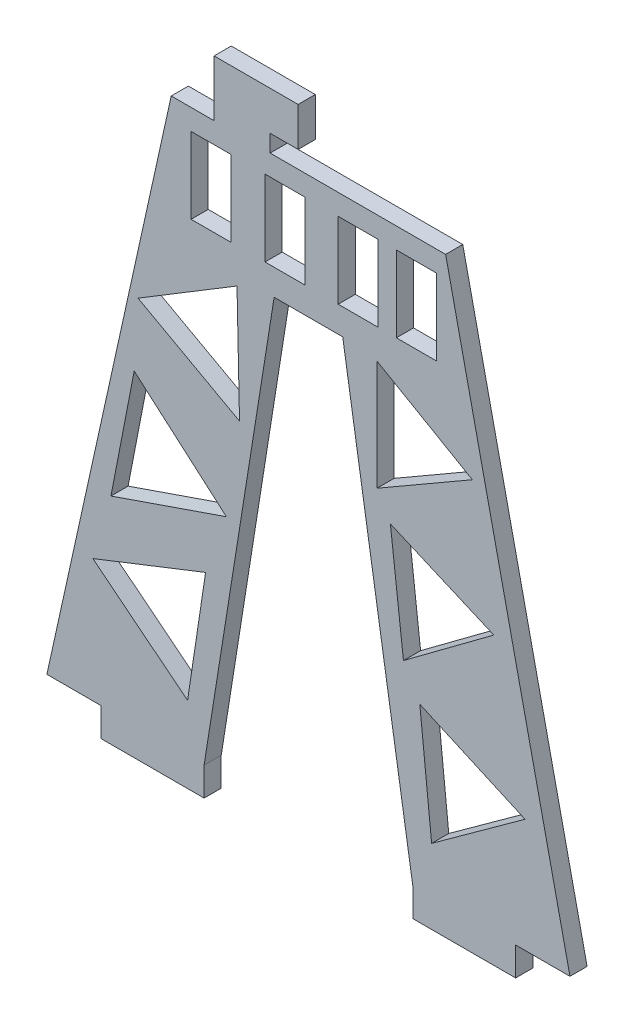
ISO-10303-21;
HEADER;
FILE_DESCRIPTION(('STEP AP214'),'2;1');
FILE_NAME('part.step','',(''),(''),'','','');
FILE_SCHEMA(('AUTOMOTIVE_DESIGN { 1 0 10303 214 1 1 1 1 }'));
ENDSEC;
DATA;
#1=APPLICATION_CONTEXT('core data for automotive mechanical design processes');
#2=APPLICATION_PROTOCOL_DEFINITION('international standard','automotive_design',2000,#1);
#3=PRODUCT_CONTEXT('',#1,'mechanical');
#4=PRODUCT('Part','Part','',(#3));
#5=PRODUCT_RELATED_PRODUCT_CATEGORY('part','',(#4));
#6=PRODUCT_DEFINITION_FORMATION('','',#4);
#7=PRODUCT_DEFINITION_CONTEXT('part definition',#1,'design');
#8=PRODUCT_DEFINITION('design','',#6,#7);
#9=PRODUCT_DEFINITION_SHAPE('','',#8);
#10=(LENGTH_UNIT() NAMED_UNIT(*) SI_UNIT(.MILLI.,.METRE.));
#11=(NAMED_UNIT(*) PLANE_ANGLE_UNIT() SI_UNIT($,.RADIAN.));
#12=(NAMED_UNIT(*) SI_UNIT($,.STERADIAN.) SOLID_ANGLE_UNIT());
#13=UNCERTAINTY_MEASURE_WITH_UNIT(LENGTH_MEASURE(1.E-05),#10,'distance_accuracy_value','');
#14=(GEOMETRIC_REPRESENTATION_CONTEXT(3) GLOBAL_UNCERTAINTY_ASSIGNED_CONTEXT((#13)) GLOBAL_UNIT_ASSIGNED_CONTEXT((#10,
#11,#12)) REPRESENTATION_CONTEXT('',''));
#15=CARTESIAN_POINT('',(0.,0.,0.));
#16=DIRECTION('',(0.,0.,1.));
#17=DIRECTION('',(1.,0.,0.));
#18=AXIS2_PLACEMENT_3D('',#15,#16,#17);
#19=CARTESIAN_POINT('',(-21.7129196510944,37.6078800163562,3.));
#20=DIRECTION('',(0.5,-0.866025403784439,0.));
#21=DIRECTION('',(0.866025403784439,0.5,0.));
#22=AXIS2_PLACEMENT_3D('',#19,#20,#21);
#23=PLANE('',#22);
#24=DIRECTION('',(-0.866025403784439,-0.5,0.));
#25=VECTOR('',#24,1.);
#26=CARTESIAN_POINT('',(-21.7129196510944,37.6078800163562,0.));
#27=LINE('',#26,#25);
#28=CARTESIAN_POINT('',(28.6731076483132,66.698266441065,0.));
#29=VERTEX_POINT('',#28);
#30=CARTESIAN_POINT('',(11.9929947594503,57.0679987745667,0.));
#31=VERTEX_POINT('',#30);
#32=EDGE_CURVE('E402',#29,#31,#27,.T.);
#33=ORIENTED_EDGE('',*,*,#32,.T.);
#34=DIRECTION('',(0.,0.,-1.));
#35=VECTOR('',#34,1.);
#36=CARTESIAN_POINT('',(11.9929947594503,57.0679987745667,3.));
#37=LINE('',#36,#35);
#38=CARTESIAN_POINT('',(11.9929947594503,57.0679987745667,3.));
#39=VERTEX_POINT('',#38);
#40=EDGE_CURVE('E11',#39,#31,#37,.T.);
#41=ORIENTED_EDGE('',*,*,#40,.F.);
#42=DIRECTION('',(-0.866025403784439,-0.5,0.));
#43=VECTOR('',#42,1.);
#44=CARTESIAN_POINT('',(-21.7129196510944,37.6078800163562,3.));
#45=LINE('',#44,#43);
#46=CARTESIAN_POINT('',(28.6731076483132,66.698266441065,3.));
#47=VERTEX_POINT('',#46);
#48=EDGE_CURVE('E394',#47,#39,#45,.T.);
#49=ORIENTED_EDGE('',*,*,#48,.F.);
#50=DIRECTION('',(0.,0.,-1.));
#51=VECTOR('',#50,1.);
#52=CARTESIAN_POINT('',(28.6731076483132,66.698266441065,3.));
#53=LINE('',#52,#51);
#54=EDGE_CURVE('E403',#47,#29,#53,.T.);
#55=ORIENTED_EDGE('',*,*,#54,.T.);
#56=EDGE_LOOP('',(#33,#41,#49,#55));
#57=FACE_BOUND('',#56,.T.);
#58=ADVANCED_FACE('F41',(#57),#23,.F.);
#59=CARTESIAN_POINT('',(11.9929947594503,0.,3.));
#60=DIRECTION('',(-1.,0.,0.));
#61=DIRECTION('',(0.,0.,1.));
#62=AXIS2_PLACEMENT_3D('',#59,#60,#61);
#63=PLANE('',#62);
#64=DIRECTION('',(0.,1.,0.));
#65=VECTOR('',#64,1.);
#66=CARTESIAN_POINT('',(11.9929947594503,0.,0.));
#67=LINE('',#66,#65);
#68=CARTESIAN_POINT('',(11.9929947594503,76.3285341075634,0.));
#69=VERTEX_POINT('',#68);
#70=EDGE_CURVE('E225',#31,#69,#67,.T.);
#71=ORIENTED_EDGE('',*,*,#70,.T.);
#72=DIRECTION('',(0.,0.,-1.));
#73=VECTOR('',#72,1.);
#74=CARTESIAN_POINT('',(11.9929947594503,76.3285341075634,3.));
#75=LINE('',#74,#73);
#76=CARTESIAN_POINT('',(11.9929947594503,76.3285341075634,3.));
#77=VERTEX_POINT('',#76);
#78=EDGE_CURVE('E51',#77,#69,#75,.T.);
#79=ORIENTED_EDGE('',*,*,#78,.F.);
#80=DIRECTION('',(0.,1.,0.));
#81=VECTOR('',#80,1.);
#82=CARTESIAN_POINT('',(11.9929947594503,0.,3.));
#83=LINE('',#82,#81);
#84=EDGE_CURVE('E390',#39,#77,#83,.T.);
#85=ORIENTED_EDGE('',*,*,#84,.F.);
#86=ORIENTED_EDGE('',*,*,#40,.T.);
#87=EDGE_LOOP('',(#71,#79,#85,#86));
#88=FACE_BOUND('',#87,.T.);
#89=ADVANCED_FACE('F391',(#88),#63,.F.);
#90=CARTESIAN_POINT('',(0.,94.8662072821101,3.));
#91=DIRECTION('',(0.,1.,0.));
#92=DIRECTION('',(0.,0.,1.));
#93=AXIS2_PLACEMENT_3D('',#90,#91,#92);
#94=PLANE('',#93);
#95=DIRECTION('',(1.,0.,0.));
#96=VECTOR('',#95,1.);
#97=CARTESIAN_POINT('',(0.,94.8662072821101,0.));
#98=LINE('',#97,#96);
#99=CARTESIAN_POINT('',(15.3856667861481,94.8662072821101,0.));
#100=VERTEX_POINT('',#99);
#101=CARTESIAN_POINT('',(22.3856667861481,94.8662072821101,0.));
#102=VERTEX_POINT('',#101);
#103=EDGE_CURVE('E672',#100,#102,#98,.T.);
#104=ORIENTED_EDGE('',*,*,#103,.T.);
#105=DIRECTION('',(0.,0.,-1.));
#106=VECTOR('',#105,1.);
#107=CARTESIAN_POINT('',(22.3856667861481,94.8662072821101,3.));
#108=LINE('',#107,#106);
#109=CARTESIAN_POINT('',(22.3856667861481,94.8662072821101,3.));
#110=VERTEX_POINT('',#109);
#111=EDGE_CURVE('E416',#110,#102,#108,.T.);
#112=ORIENTED_EDGE('',*,*,#111,.F.);
#113=DIRECTION('',(1.,0.,0.));
#114=VECTOR('',#113,1.);
#115=CARTESIAN_POINT('',(0.,94.8662072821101,3.));
#116=LINE('',#115,#114);
#117=CARTESIAN_POINT('',(15.3856667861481,94.8662072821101,3.));
#118=VERTEX_POINT('',#117);
#119=EDGE_CURVE('E705',#118,#110,#116,.T.);
#120=ORIENTED_EDGE('',*,*,#119,.F.);
#121=DIRECTION('',(0.,0.,-1.));
#122=VECTOR('',#121,1.);
#123=CARTESIAN_POINT('',(15.3856667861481,94.8662072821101,3.));
#124=LINE('',#123,#122);
#125=EDGE_CURVE('E418',#118,#100,#124,.T.);
#126=ORIENTED_EDGE('',*,*,#125,.T.);
#127=EDGE_LOOP('',(#104,#112,#120,#126));
#128=FACE_BOUND('',#127,.T.);
#129=ADVANCED_FACE('F695',(#128),#94,.F.);
#130=CARTESIAN_POINT('',(22.3856667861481,0.,3.));
#131=DIRECTION('',(1.,0.,0.));
#132=DIRECTION('',(0.,0.,-1.));
#133=AXIS2_PLACEMENT_3D('',#130,#131,#132);
#134=PLANE('',#133);
#135=DIRECTION('',(0.,-1.,0.));
#136=VECTOR('',#135,1.);
#137=CARTESIAN_POINT('',(22.3856667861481,0.,0.));
#138=LINE('',#137,#136);
#139=CARTESIAN_POINT('',(22.3856667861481,81.551916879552,0.));
#140=VERTEX_POINT('',#139);
#141=EDGE_CURVE('E675',#102,#140,#138,.T.);
#142=ORIENTED_EDGE('',*,*,#141,.T.);
#143=DIRECTION('',(0.,0.,-1.));
#144=VECTOR('',#143,1.);
#145=CARTESIAN_POINT('',(22.3856667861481,81.551916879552,3.));
#146=LINE('',#145,#144);
#147=CARTESIAN_POINT('',(22.3856667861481,81.551916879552,3.));
#148=VERTEX_POINT('',#147);
#149=EDGE_CURVE('E423',#148,#140,#146,.T.);
#150=ORIENTED_EDGE('',*,*,#149,.F.);
#151=DIRECTION('',(0.,-1.,0.));
#152=VECTOR('',#151,1.);
#153=CARTESIAN_POINT('',(22.3856667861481,0.,3.));
#154=LINE('',#153,#152);
#155=EDGE_CURVE('E691',#110,#148,#154,.T.);
#156=ORIENTED_EDGE('',*,*,#155,.F.);
#157=ORIENTED_EDGE('',*,*,#111,.T.);
#158=EDGE_LOOP('',(#142,#150,#156,#157));
#159=FACE_BOUND('',#158,.T.);
#160=ADVANCED_FACE('F689',(#159),#134,.F.);
#161=CARTESIAN_POINT('',(0.,81.551916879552,3.));
#162=DIRECTION('',(0.,1.,0.));
#163=DIRECTION('',(0.,0.,1.));
#164=AXIS2_PLACEMENT_3D('',#161,#162,#163);
#165=PLANE('',#164);
#166=DIRECTION('',(1.,0.,0.));
#167=VECTOR('',#166,1.);
#168=CARTESIAN_POINT('',(0.,81.551916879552,0.));
#169=LINE('',#168,#167);
#170=CARTESIAN_POINT('',(15.3856667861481,81.551916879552,0.));
#171=VERTEX_POINT('',#170);
#172=EDGE_CURVE('E409',#171,#140,#169,.T.);
#173=ORIENTED_EDGE('',*,*,#172,.F.);
#174=DIRECTION('',(0.,0.,-1.));
#175=VECTOR('',#174,1.);
#176=CARTESIAN_POINT('',(15.3856667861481,81.551916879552,3.));
#177=LINE('',#176,#175);
#178=CARTESIAN_POINT('',(15.3856667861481,81.551916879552,3.));
#179=VERTEX_POINT('',#178);
#180=EDGE_CURVE('E420',#179,#171,#177,.T.);
#181=ORIENTED_EDGE('',*,*,#180,.F.);
#182=DIRECTION('',(1.,0.,0.));
#183=VECTOR('',#182,1.);
#184=CARTESIAN_POINT('',(0.,81.551916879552,3.));
#185=LINE('',#184,#183);
#186=EDGE_CURVE('E687',#179,#148,#185,.T.);
#187=ORIENTED_EDGE('',*,*,#186,.T.);
#188=ORIENTED_EDGE('',*,*,#149,.T.);
#189=EDGE_LOOP('',(#173,#181,#187,#188));
#190=FACE_BOUND('',#189,.T.);
#191=ADVANCED_FACE('F683',(#190),#165,.T.);
#192=CARTESIAN_POINT('',(0.,94.8662072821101,3.));
#193=DIRECTION('',(0.,1.,0.));
#194=DIRECTION('',(0.,0.,1.));
#195=AXIS2_PLACEMENT_3D('',#192,#193,#194);
#196=PLANE('',#195);
#197=DIRECTION('',(1.,0.,0.));
#198=VECTOR('',#197,1.);
#199=CARTESIAN_POINT('',(0.,94.8662072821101,0.));
#200=LINE('',#199,#198);
#201=CARTESIAN_POINT('',(5.20791594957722,94.8662072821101,0.));
#202=VERTEX_POINT('',#201);
#203=CARTESIAN_POINT('',(12.2079159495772,94.8662072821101,0.));
#204=VERTEX_POINT('',#203);
#205=EDGE_CURVE('E660',#202,#204,#200,.T.);
#206=ORIENTED_EDGE('',*,*,#205,.T.);
#207=DIRECTION('',(0.,0.,-1.));
#208=VECTOR('',#207,1.);
#209=CARTESIAN_POINT('',(12.2079159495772,94.8662072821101,3.));
#210=LINE('',#209,#208);
#211=CARTESIAN_POINT('',(12.2079159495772,94.8662072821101,3.));
#212=VERTEX_POINT('',#211);
#213=EDGE_CURVE('E421',#212,#204,#210,.T.);
#214=ORIENTED_EDGE('',*,*,#213,.F.);
#215=DIRECTION('',(1.,0.,0.));
#216=VECTOR('',#215,1.);
#217=CARTESIAN_POINT('',(0.,94.8662072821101,3.));
#218=LINE('',#217,#216);
#219=CARTESIAN_POINT('',(5.20791594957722,94.8662072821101,3.));
#220=VERTEX_POINT('',#219);
#221=EDGE_CURVE('E715',#220,#212,#218,.T.);
#222=ORIENTED_EDGE('',*,*,#221,.F.);
#223=DIRECTION('',(0.,0.,-1.));
#224=VECTOR('',#223,1.);
#225=CARTESIAN_POINT('',(5.20791594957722,94.8662072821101,3.));
#226=LINE('',#225,#224);
#227=EDGE_CURVE('E427',#220,#202,#226,.T.);
#228=ORIENTED_EDGE('',*,*,#227,.T.);
#229=EDGE_LOOP('',(#206,#214,#222,#228));
#230=FACE_BOUND('',#229,.T.);
#231=ADVANCED_FACE('F856',(#230),#196,.F.);
#232=CARTESIAN_POINT('',(12.2079159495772,0.,3.));
#233=DIRECTION('',(1.,0.,0.));
#234=DIRECTION('',(0.,1.,0.));
#235=AXIS2_PLACEMENT_3D('',#232,#233,#234);
#236=PLANE('',#235);
#237=DIRECTION('',(0.,-1.,0.));
#238=VECTOR('',#237,1.);
#239=CARTESIAN_POINT('',(12.2079159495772,0.,0.));
#240=LINE('',#239,#238);
#241=CARTESIAN_POINT('',(12.2079159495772,81.551916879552,0.));
#242=VERTEX_POINT('',#241);
#243=EDGE_CURVE('E663',#204,#242,#240,.T.);
#244=ORIENTED_EDGE('',*,*,#243,.T.);
#245=DIRECTION('',(0.,0.,-1.));
#246=VECTOR('',#245,1.);
#247=CARTESIAN_POINT('',(12.2079159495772,81.551916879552,3.));
#248=LINE('',#247,#246);
#249=CARTESIAN_POINT('',(12.2079159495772,81.551916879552,3.));
#250=VERTEX_POINT('',#249);
#251=EDGE_CURVE('E432',#250,#242,#248,.T.);
#252=ORIENTED_EDGE('',*,*,#251,.F.);
#253=DIRECTION('',(0.,-1.,0.));
#254=VECTOR('',#253,1.);
#255=CARTESIAN_POINT('',(12.2079159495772,0.,3.));
#256=LINE('',#255,#254);
#257=EDGE_CURVE('E713',#212,#250,#256,.T.);
#258=ORIENTED_EDGE('',*,*,#257,.F.);
#259=ORIENTED_EDGE('',*,*,#213,.T.);
#260=EDGE_LOOP('',(#244,#252,#258,#259));
#261=FACE_BOUND('',#260,.T.);
#262=ADVANCED_FACE('F869',(#261),#236,.F.);
#263=CARTESIAN_POINT('',(0.,81.551916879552,3.));
#264=DIRECTION('',(0.,1.,0.));
#265=DIRECTION('',(0.,0.,1.));
#266=AXIS2_PLACEMENT_3D('',#263,#264,#265);
#267=PLANE('',#266);
#268=DIRECTION('',(1.,0.,0.));
#269=VECTOR('',#268,1.);
#270=CARTESIAN_POINT('',(0.,81.551916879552,0.));
#271=LINE('',#270,#269);
#272=CARTESIAN_POINT('',(5.20791594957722,81.551916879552,0.));
#273=VERTEX_POINT('',#272);
#274=EDGE_CURVE('E666',#273,#242,#271,.T.);
#275=ORIENTED_EDGE('',*,*,#274,.F.);
#276=DIRECTION('',(0.,0.,-1.));
#277=VECTOR('',#276,1.);
#278=CARTESIAN_POINT('',(5.20791594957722,81.551916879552,3.));
#279=LINE('',#278,#277);
#280=CARTESIAN_POINT('',(5.20791594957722,81.551916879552,3.));
#281=VERTEX_POINT('',#280);
#282=EDGE_CURVE('E429',#281,#273,#279,.T.);
#283=ORIENTED_EDGE('',*,*,#282,.F.);
#284=DIRECTION('',(1.,0.,0.));
#285=VECTOR('',#284,1.);
#286=CARTESIAN_POINT('',(0.,81.551916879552,3.));
#287=LINE('',#286,#285);
#288=EDGE_CURVE('E710',#281,#250,#287,.T.);
#289=ORIENTED_EDGE('',*,*,#288,.T.);
#290=ORIENTED_EDGE('',*,*,#251,.T.);
#291=EDGE_LOOP('',(#275,#283,#289,#290));
#292=FACE_BOUND('',#291,.T.);
#293=ADVANCED_FACE('F865',(#292),#267,.T.);
#294=CARTESIAN_POINT('',(0.,94.8662072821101,3.));
#295=DIRECTION('',(0.,1.,0.));
#296=DIRECTION('',(0.,0.,1.));
#297=AXIS2_PLACEMENT_3D('',#294,#295,#296);
#298=PLANE('',#297);
#299=DIRECTION('',(1.,0.,0.));
#300=VECTOR('',#299,1.);
#301=CARTESIAN_POINT('',(0.,94.8662072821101,0.));
#302=LINE('',#301,#300);
#303=CARTESIAN_POINT('',(-7.59428636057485,94.8662072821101,0.));
#304=VERTEX_POINT('',#303);
#305=CARTESIAN_POINT('',(-0.594286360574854,94.8662072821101,0.));
#306=VERTEX_POINT('',#305);
#307=EDGE_CURVE('E648',#304,#306,#302,.T.);
#308=ORIENTED_EDGE('',*,*,#307,.T.);
#309=DIRECTION('',(0.,0.,-1.));
#310=VECTOR('',#309,1.);
#311=CARTESIAN_POINT('',(-0.594286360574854,94.8662072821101,3.));
#312=LINE('',#311,#310);
#313=CARTESIAN_POINT('',(-0.594286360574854,94.8662072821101,3.));
#314=VERTEX_POINT('',#313);
#315=EDGE_CURVE('E430',#314,#306,#312,.T.);
#316=ORIENTED_EDGE('',*,*,#315,.F.);
#317=DIRECTION('',(1.,0.,0.));
#318=VECTOR('',#317,1.);
#319=CARTESIAN_POINT('',(0.,94.8662072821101,3.));
#320=LINE('',#319,#318);
#321=CARTESIAN_POINT('',(-7.59428636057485,94.8662072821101,3.));
#322=VERTEX_POINT('',#321);
#323=EDGE_CURVE('E726',#322,#314,#320,.T.);
#324=ORIENTED_EDGE('',*,*,#323,.F.);
#325=DIRECTION('',(0.,0.,-1.));
#326=VECTOR('',#325,1.);
#327=CARTESIAN_POINT('',(-7.59428636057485,94.8662072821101,3.));
#328=LINE('',#327,#326);
#329=EDGE_CURVE('E436',#322,#304,#328,.T.);
#330=ORIENTED_EDGE('',*,*,#329,.T.);
#331=EDGE_LOOP('',(#308,#316,#324,#330));
#332=FACE_BOUND('',#331,.T.);
#333=ADVANCED_FACE('F868',(#332),#298,.F.);
#334=CARTESIAN_POINT('',(-0.594286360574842,0.,3.));
#335=DIRECTION('',(1.,0.,0.));
#336=DIRECTION('',(0.,1.,0.));
#337=AXIS2_PLACEMENT_3D('',#334,#335,#336);
#338=PLANE('',#337);
#339=DIRECTION('',(0.,-1.,0.));
#340=VECTOR('',#339,1.);
#341=CARTESIAN_POINT('',(-0.594286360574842,0.,0.));
#342=LINE('',#341,#340);
#343=CARTESIAN_POINT('',(-0.594286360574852,81.551916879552,0.));
#344=VERTEX_POINT('',#343);
#345=EDGE_CURVE('E651',#306,#344,#342,.T.);
#346=ORIENTED_EDGE('',*,*,#345,.T.);
#347=DIRECTION('',(0.,0.,-1.));
#348=VECTOR('',#347,1.);
#349=CARTESIAN_POINT('',(-0.594286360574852,81.551916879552,3.));
#350=LINE('',#349,#348);
#351=CARTESIAN_POINT('',(-0.594286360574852,81.551916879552,3.));
#352=VERTEX_POINT('',#351);
#353=EDGE_CURVE('E441',#352,#344,#350,.T.);
#354=ORIENTED_EDGE('',*,*,#353,.F.);
#355=DIRECTION('',(0.,-1.,0.));
#356=VECTOR('',#355,1.);
#357=CARTESIAN_POINT('',(-0.594286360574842,0.,3.));
#358=LINE('',#357,#356);
#359=EDGE_CURVE('E724',#314,#352,#358,.T.);
#360=ORIENTED_EDGE('',*,*,#359,.F.);
#361=ORIENTED_EDGE('',*,*,#315,.T.);
#362=EDGE_LOOP('',(#346,#354,#360,#361));
#363=FACE_BOUND('',#362,.T.);
#364=ADVANCED_FACE('F885',(#363),#338,.F.);
#365=CARTESIAN_POINT('',(0.,81.551916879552,3.));
#366=DIRECTION('',(0.,1.,0.));
#367=DIRECTION('',(0.,0.,1.));
#368=AXIS2_PLACEMENT_3D('',#365,#366,#367);
#369=PLANE('',#368);
#370=DIRECTION('',(1.,0.,0.));
#371=VECTOR('',#370,1.);
#372=CARTESIAN_POINT('',(0.,81.551916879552,0.));
#373=LINE('',#372,#371);
#374=CARTESIAN_POINT('',(-7.59428636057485,81.551916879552,0.));
#375=VERTEX_POINT('',#374);
#376=EDGE_CURVE('E654',#375,#344,#373,.T.);
#377=ORIENTED_EDGE('',*,*,#376,.F.);
#378=DIRECTION('',(0.,0.,-1.));
#379=VECTOR('',#378,1.);
#380=CARTESIAN_POINT('',(-7.59428636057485,81.551916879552,3.));
#381=LINE('',#380,#379);
#382=CARTESIAN_POINT('',(-7.59428636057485,81.551916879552,3.));
#383=VERTEX_POINT('',#382);
#384=EDGE_CURVE('E438',#383,#375,#381,.T.);
#385=ORIENTED_EDGE('',*,*,#384,.F.);
#386=DIRECTION('',(1.,0.,0.));
#387=VECTOR('',#386,1.);
#388=CARTESIAN_POINT('',(0.,81.551916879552,3.));
#389=LINE('',#388,#387);
#390=EDGE_CURVE('E721',#383,#352,#389,.T.);
#391=ORIENTED_EDGE('',*,*,#390,.T.);
#392=ORIENTED_EDGE('',*,*,#353,.T.);
#393=EDGE_LOOP('',(#377,#385,#391,#392));
#394=FACE_BOUND('',#393,.T.);
#395=ADVANCED_FACE('F881',(#394),#369,.T.);
#396=CARTESIAN_POINT('',(0.,94.8662072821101,3.));
#397=DIRECTION('',(0.,1.,0.));
#398=DIRECTION('',(0.,0.,1.));
#399=AXIS2_PLACEMENT_3D('',#396,#397,#398);
#400=PLANE('',#399);
#401=DIRECTION('',(1.,0.,0.));
#402=VECTOR('',#401,1.);
#403=CARTESIAN_POINT('',(0.,94.8662072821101,0.));
#404=LINE('',#403,#402);
#405=CARTESIAN_POINT('',(-20.5245106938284,94.8662072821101,0.));
#406=VERTEX_POINT('',#405);
#407=CARTESIAN_POINT('',(-13.5245106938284,94.8662072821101,0.));
#408=VERTEX_POINT('',#407);
#409=EDGE_CURVE('E636',#406,#408,#404,.T.);
#410=ORIENTED_EDGE('',*,*,#409,.T.);
#411=DIRECTION('',(0.,0.,-1.));
#412=VECTOR('',#411,1.);
#413=CARTESIAN_POINT('',(-13.5245106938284,94.8662072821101,3.));
#414=LINE('',#413,#412);
#415=CARTESIAN_POINT('',(-13.5245106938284,94.8662072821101,3.));
#416=VERTEX_POINT('',#415);
#417=EDGE_CURVE('E439',#416,#408,#414,.T.);
#418=ORIENTED_EDGE('',*,*,#417,.F.);
#419=DIRECTION('',(1.,0.,0.));
#420=VECTOR('',#419,1.);
#421=CARTESIAN_POINT('',(0.,94.8662072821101,3.));
#422=LINE('',#421,#420);
#423=CARTESIAN_POINT('',(-20.5245106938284,94.8662072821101,3.));
#424=VERTEX_POINT('',#423);
#425=EDGE_CURVE('E737',#424,#416,#422,.T.);
#426=ORIENTED_EDGE('',*,*,#425,.F.);
#427=DIRECTION('',(0.,0.,-1.));
#428=VECTOR('',#427,1.);
#429=CARTESIAN_POINT('',(-20.5245106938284,94.8662072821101,3.));
#430=LINE('',#429,#428);
#431=EDGE_CURVE('E445',#424,#406,#430,.T.);
#432=ORIENTED_EDGE('',*,*,#431,.T.);
#433=EDGE_LOOP('',(#410,#418,#426,#432));
#434=FACE_BOUND('',#433,.T.);
#435=ADVANCED_FACE('F884',(#434),#400,.F.);
#436=CARTESIAN_POINT('',(-13.5245106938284,0.,3.));
#437=DIRECTION('',(1.,0.,0.));
#438=DIRECTION('',(0.,1.,0.));
#439=AXIS2_PLACEMENT_3D('',#436,#437,#438);
#440=PLANE('',#439);
#441=DIRECTION('',(0.,-1.,0.));
#442=VECTOR('',#441,1.);
#443=CARTESIAN_POINT('',(-13.5245106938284,0.,0.));
#444=LINE('',#443,#442);
#445=CARTESIAN_POINT('',(-13.5245106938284,81.551916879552,0.));
#446=VERTEX_POINT('',#445);
#447=EDGE_CURVE('E639',#408,#446,#444,.T.);
#448=ORIENTED_EDGE('',*,*,#447,.T.);
#449=DIRECTION('',(0.,0.,-1.));
#450=VECTOR('',#449,1.);
#451=CARTESIAN_POINT('',(-13.5245106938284,81.551916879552,3.));
#452=LINE('',#451,#450);
#453=CARTESIAN_POINT('',(-13.5245106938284,81.551916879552,3.));
#454=VERTEX_POINT('',#453);
#455=EDGE_CURVE('E450',#454,#446,#452,.T.);
#456=ORIENTED_EDGE('',*,*,#455,.F.);
#457=DIRECTION('',(0.,-1.,0.));
#458=VECTOR('',#457,1.);
#459=CARTESIAN_POINT('',(-13.5245106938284,0.,3.));
#460=LINE('',#459,#458);
#461=EDGE_CURVE('E735',#416,#454,#460,.T.);
#462=ORIENTED_EDGE('',*,*,#461,.F.);
#463=ORIENTED_EDGE('',*,*,#417,.T.);
#464=EDGE_LOOP('',(#448,#456,#462,#463));
#465=FACE_BOUND('',#464,.T.);
#466=ADVANCED_FACE('F901',(#465),#440,.F.);
#467=CARTESIAN_POINT('',(0.,81.551916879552,3.));
#468=DIRECTION('',(0.,1.,0.));
#469=DIRECTION('',(0.,0.,1.));
#470=AXIS2_PLACEMENT_3D('',#467,#468,#469);
#471=PLANE('',#470);
#472=DIRECTION('',(1.,0.,0.));
#473=VECTOR('',#472,1.);
#474=CARTESIAN_POINT('',(0.,81.551916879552,0.));
#475=LINE('',#474,#473);
#476=CARTESIAN_POINT('',(-20.5245106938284,81.551916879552,0.));
#477=VERTEX_POINT('',#476);
#478=EDGE_CURVE('E642',#477,#446,#475,.T.);
#479=ORIENTED_EDGE('',*,*,#478,.F.);
#480=DIRECTION('',(0.,0.,-1.));
#481=VECTOR('',#480,1.);
#482=CARTESIAN_POINT('',(-20.5245106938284,81.551916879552,3.));
#483=LINE('',#482,#481);
#484=CARTESIAN_POINT('',(-20.5245106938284,81.551916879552,3.));
#485=VERTEX_POINT('',#484);
#486=EDGE_CURVE('E447',#485,#477,#483,.T.);
#487=ORIENTED_EDGE('',*,*,#486,.F.);
#488=DIRECTION('',(1.,0.,0.));
#489=VECTOR('',#488,1.);
#490=CARTESIAN_POINT('',(0.,81.551916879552,3.));
#491=LINE('',#490,#489);
#492=EDGE_CURVE('E732',#485,#454,#491,.T.);
#493=ORIENTED_EDGE('',*,*,#492,.T.);
#494=ORIENTED_EDGE('',*,*,#455,.T.);
#495=EDGE_LOOP('',(#479,#487,#493,#494));
#496=FACE_BOUND('',#495,.T.);
#497=ADVANCED_FACE('F897',(#496),#471,.T.);
#498=CARTESIAN_POINT('',(0.,0.,3.));
#499=DIRECTION('',(0.,1.,0.));
#500=DIRECTION('',(-1.,0.,0.));
#501=AXIS2_PLACEMENT_3D('',#498,#499,#500);
#502=PLANE('',#501);
#503=DIRECTION('',(1.,0.,0.));
#504=VECTOR('',#503,1.);
#505=CARTESIAN_POINT('',(0.,0.,0.));
#506=LINE('',#505,#504);
#507=CARTESIAN_POINT('',(36.25,0.,0.));
#508=VERTEX_POINT('',#507);
#509=CARTESIAN_POINT('',(45.75,0.,0.));
#510=VERTEX_POINT('',#509);
#511=EDGE_CURVE('E584',#508,#510,#506,.T.);
#512=ORIENTED_EDGE('',*,*,#511,.T.);
#513=DIRECTION('',(0.,0.,-1.));
#514=VECTOR('',#513,1.);
#515=CARTESIAN_POINT('',(45.75,0.,3.));
#516=LINE('',#515,#514);
#517=CARTESIAN_POINT('',(45.75,0.,3.));
#518=VERTEX_POINT('',#517);
#519=EDGE_CURVE('E448',#518,#510,#516,.T.);
#520=ORIENTED_EDGE('',*,*,#519,.F.);
#521=DIRECTION('',(1.,0.,0.));
#522=VECTOR('',#521,1.);
#523=CARTESIAN_POINT('',(0.,0.,3.));
#524=LINE('',#523,#522);
#525=CARTESIAN_POINT('',(36.25,0.,3.));
#526=VERTEX_POINT('',#525);
#527=EDGE_CURVE('E786',#526,#518,#524,.T.);
#528=ORIENTED_EDGE('',*,*,#527,.F.);
#529=DIRECTION('',(0.,0.,-1.));
#530=VECTOR('',#529,1.);
#531=CARTESIAN_POINT('',(36.25,0.,3.));
#532=LINE('',#531,#530);
#533=EDGE_CURVE('E454',#526,#508,#532,.T.);
#534=ORIENTED_EDGE('',*,*,#533,.T.);
#535=EDGE_LOOP('',(#512,#520,#528,#534));
#536=FACE_BOUND('',#535,.T.);
#537=ADVANCED_FACE('F900',(#536),#502,.F.);
#538=CARTESIAN_POINT('',(43.623027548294,9.63249593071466,3.));
#539=DIRECTION('',(0.976477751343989,0.215618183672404,0.));
#540=DIRECTION('',(-0.215618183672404,0.976477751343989,0.));
#541=AXIS2_PLACEMENT_3D('',#538,#539,#540);
#542=PLANE('',#541);
#543=DIRECTION('',(0.215618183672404,-0.976477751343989,0.));
#544=VECTOR('',#543,1.);
#545=CARTESIAN_POINT('',(43.623027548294,9.63249593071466,0.));
#546=LINE('',#545,#544);
#547=CARTESIAN_POINT('',(24.,98.5,0.));
#548=VERTEX_POINT('',#547);
#549=EDGE_CURVE('E587',#548,#510,#546,.T.);
#550=ORIENTED_EDGE('',*,*,#549,.F.);
#551=DIRECTION('',(0.,0.,-1.));
#552=VECTOR('',#551,1.);
#553=CARTESIAN_POINT('',(24.,98.5,3.));
#554=LINE('',#553,#552);
#555=CARTESIAN_POINT('',(24.,98.5,3.));
#556=VERTEX_POINT('',#555);
#557=EDGE_CURVE('E497',#556,#548,#554,.T.);
#558=ORIENTED_EDGE('',*,*,#557,.F.);
#559=DIRECTION('',(0.215618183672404,-0.976477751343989,0.));
#560=VECTOR('',#559,1.);
#561=CARTESIAN_POINT('',(43.623027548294,9.63249593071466,3.));
#562=LINE('',#561,#560);
#563=EDGE_CURVE('E783',#556,#518,#562,.T.);
#564=ORIENTED_EDGE('',*,*,#563,.T.);
#565=ORIENTED_EDGE('',*,*,#519,.T.);
#566=EDGE_LOOP('',(#550,#558,#564,#565));
#567=FACE_BOUND('',#566,.T.);
#568=ADVANCED_FACE('F979',(#567),#542,.T.);
#569=CARTESIAN_POINT('',(0.,98.5,3.));
#570=DIRECTION('',(0.,1.,0.));
#571=DIRECTION('',(-1.,0.,0.));
#572=AXIS2_PLACEMENT_3D('',#569,#570,#571);
#573=PLANE('',#572);
#574=DIRECTION('',(1.,0.,0.));
#575=VECTOR('',#574,1.);
#576=CARTESIAN_POINT('',(0.,98.5,0.));
#577=LINE('',#576,#575);
#578=CARTESIAN_POINT('',(-6.7,98.5,0.));
#579=VERTEX_POINT('',#578);
#580=EDGE_CURVE('E590',#579,#548,#577,.T.);
#581=ORIENTED_EDGE('',*,*,#580,.F.);
#582=DIRECTION('',(0.,0.,-1.));
#583=VECTOR('',#582,1.);
#584=CARTESIAN_POINT('',(-6.7,98.5,3.));
#585=LINE('',#584,#583);
#586=CARTESIAN_POINT('',(-6.7,98.5,3.));
#587=VERTEX_POINT('',#586);
#588=EDGE_CURVE('E495',#587,#579,#585,.T.);
#589=ORIENTED_EDGE('',*,*,#588,.F.);
#590=DIRECTION('',(1.,0.,0.));
#591=VECTOR('',#590,1.);
#592=CARTESIAN_POINT('',(0.,98.5,3.));
#593=LINE('',#592,#591);
#594=EDGE_CURVE('E780',#587,#556,#593,.T.);
#595=ORIENTED_EDGE('',*,*,#594,.T.);
#596=ORIENTED_EDGE('',*,*,#557,.T.);
#597=EDGE_LOOP('',(#581,#589,#595,#596));
#598=FACE_BOUND('',#597,.T.);
#599=ADVANCED_FACE('F959',(#598),#573,.T.);
#600=CARTESIAN_POINT('',(-6.7,0.,3.));
#601=DIRECTION('',(-1.,0.,0.));
#602=DIRECTION('',(0.,0.,1.));
#603=AXIS2_PLACEMENT_3D('',#600,#601,#602);
#604=PLANE('',#603);
#605=DIRECTION('',(0.,1.,0.));
#606=VECTOR('',#605,1.);
#607=CARTESIAN_POINT('',(-6.7,0.,0.));
#608=LINE('',#607,#606);
#609=CARTESIAN_POINT('',(-6.7,101.5,0.));
#610=VERTEX_POINT('',#609);
#611=EDGE_CURVE('E593',#579,#610,#608,.T.);
#612=ORIENTED_EDGE('',*,*,#611,.T.);
#613=DIRECTION('',(0.,0.,-1.));
#614=VECTOR('',#613,1.);
#615=CARTESIAN_POINT('',(-6.7,101.5,3.));
#616=LINE('',#615,#614);
#617=CARTESIAN_POINT('',(-6.7,101.5,3.));
#618=VERTEX_POINT('',#617);
#619=EDGE_CURVE('E493',#618,#610,#616,.T.);
#620=ORIENTED_EDGE('',*,*,#619,.F.);
#621=DIRECTION('',(0.,1.,0.));
#622=VECTOR('',#621,1.);
#623=CARTESIAN_POINT('',(-6.7,0.,3.));
#624=LINE('',#623,#622);
#625=EDGE_CURVE('E778',#587,#618,#624,.T.);
#626=ORIENTED_EDGE('',*,*,#625,.F.);
#627=ORIENTED_EDGE('',*,*,#588,.T.);
#628=EDGE_LOOP('',(#612,#620,#626,#627));
#629=FACE_BOUND('',#628,.T.);
#630=ADVANCED_FACE('F974',(#629),#604,.F.);
#631=CARTESIAN_POINT('',(0.,101.5,3.));
#632=DIRECTION('',(0.,-1.,0.));
#633=DIRECTION('',(0.,0.,-1.));
#634=AXIS2_PLACEMENT_3D('',#631,#632,#633);
#635=PLANE('',#634);
#636=DIRECTION('',(-1.,0.,0.));
#637=VECTOR('',#636,1.);
#638=CARTESIAN_POINT('',(0.,101.5,0.));
#639=LINE('',#638,#637);
#640=CARTESIAN_POINT('',(-1.8,101.5,0.));
#641=VERTEX_POINT('',#640);
#642=EDGE_CURVE('E597',#641,#610,#639,.T.);
#643=ORIENTED_EDGE('',*,*,#642,.F.);
#644=DIRECTION('',(0.,0.,-1.));
#645=VECTOR('',#644,1.);
#646=CARTESIAN_POINT('',(-1.8,101.5,3.));
#647=LINE('',#646,#645);
#648=CARTESIAN_POINT('',(-1.8,101.5,3.));
#649=VERTEX_POINT('',#648);
#650=EDGE_CURVE('E491',#649,#641,#647,.T.);
#651=ORIENTED_EDGE('',*,*,#650,.F.);
#652=DIRECTION('',(-1.,0.,0.));
#653=VECTOR('',#652,1.);
#654=CARTESIAN_POINT('',(0.,101.5,3.));
#655=LINE('',#654,#653);
#656=EDGE_CURVE('E775',#649,#618,#655,.T.);
#657=ORIENTED_EDGE('',*,*,#656,.T.);
#658=ORIENTED_EDGE('',*,*,#619,.T.);
#659=EDGE_LOOP('',(#643,#651,#657,#658));
#660=FACE_BOUND('',#659,.T.);
#661=ADVANCED_FACE('F970',(#660),#635,.T.);
#662=CARTESIAN_POINT('',(-1.79999999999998,0.,3.));
#663=DIRECTION('',(1.,0.,0.));
#664=DIRECTION('',(0.,1.,0.));
#665=AXIS2_PLACEMENT_3D('',#662,#663,#664);
#666=PLANE('',#665);
#667=DIRECTION('',(0.,-1.,0.));
#668=VECTOR('',#667,1.);
#669=CARTESIAN_POINT('',(-1.79999999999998,0.,0.));
#670=LINE('',#669,#668);
#671=CARTESIAN_POINT('',(-1.8,108.317910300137,0.));
#672=VERTEX_POINT('',#671);
#673=EDGE_CURVE('E600',#672,#641,#670,.T.);
#674=ORIENTED_EDGE('',*,*,#673,.F.);
#675=DIRECTION('',(0.,0.,-1.));
#676=VECTOR('',#675,1.);
#677=CARTESIAN_POINT('',(-1.8,108.317910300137,3.));
#678=LINE('',#677,#676);
#679=CARTESIAN_POINT('',(-1.8,108.317910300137,3.));
#680=VERTEX_POINT('',#679);
#681=EDGE_CURVE('E489',#680,#672,#678,.T.);
#682=ORIENTED_EDGE('',*,*,#681,.F.);
#683=DIRECTION('',(0.,-1.,0.));
#684=VECTOR('',#683,1.);
#685=CARTESIAN_POINT('',(-1.79999999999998,0.,3.));
#686=LINE('',#685,#684);
#687=EDGE_CURVE('E772',#680,#649,#686,.T.);
#688=ORIENTED_EDGE('',*,*,#687,.T.);
#689=ORIENTED_EDGE('',*,*,#650,.T.);
#690=EDGE_LOOP('',(#674,#682,#688,#689));
#691=FACE_BOUND('',#690,.T.);
#692=ADVANCED_FACE('F966',(#691),#666,.T.);
#693=CARTESIAN_POINT('',(0.,108.317910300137,3.));
#694=DIRECTION('',(0.,1.,0.));
#695=DIRECTION('',(0.,0.,1.));
#696=AXIS2_PLACEMENT_3D('',#693,#694,#695);
#697=PLANE('',#696);
#698=DIRECTION('',(1.,0.,0.));
#699=VECTOR('',#698,1.);
#700=CARTESIAN_POINT('',(0.,108.317910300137,0.));
#701=LINE('',#700,#699);
#702=CARTESIAN_POINT('',(-16.5,108.317910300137,0.));
#703=VERTEX_POINT('',#702);
#704=EDGE_CURVE('E603',#703,#672,#701,.T.);
#705=ORIENTED_EDGE('',*,*,#704,.F.);
#706=DIRECTION('',(0.,0.,-1.));
#707=VECTOR('',#706,1.);
#708=CARTESIAN_POINT('',(-16.5,108.317910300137,3.));
#709=LINE('',#708,#707);
#710=CARTESIAN_POINT('',(-16.5,108.317910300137,3.));
#711=VERTEX_POINT('',#710);
#712=EDGE_CURVE('E487',#711,#703,#709,.T.);
#713=ORIENTED_EDGE('',*,*,#712,.F.);
#714=DIRECTION('',(1.,0.,0.));
#715=VECTOR('',#714,1.);
#716=CARTESIAN_POINT('',(0.,108.317910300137,3.));
#717=LINE('',#716,#715);
#718=EDGE_CURVE('E769',#711,#680,#717,.T.);
#719=ORIENTED_EDGE('',*,*,#718,.T.);
#720=ORIENTED_EDGE('',*,*,#681,.T.);
#721=EDGE_LOOP('',(#705,#713,#719,#720));
#722=FACE_BOUND('',#721,.T.);
#723=ADVANCED_FACE('F962',(#722),#697,.T.);
#724=CARTESIAN_POINT('',(-16.5,0.,3.));
#725=DIRECTION('',(-1.,0.,0.));
#726=DIRECTION('',(0.,0.,1.));
#727=AXIS2_PLACEMENT_3D('',#724,#725,#726);
#728=PLANE('',#727);
#729=DIRECTION('',(0.,1.,0.));
#730=VECTOR('',#729,1.);
#731=CARTESIAN_POINT('',(-16.5,0.,0.));
#732=LINE('',#731,#730);
#733=CARTESIAN_POINT('',(-16.5,98.5,0.));
#734=VERTEX_POINT('',#733);
#735=EDGE_CURVE('E606',#734,#703,#732,.T.);
#736=ORIENTED_EDGE('',*,*,#735,.F.);
#737=DIRECTION('',(0.,0.,-1.));
#738=VECTOR('',#737,1.);
#739=CARTESIAN_POINT('',(-16.5,98.5,3.));
#740=LINE('',#739,#738);
#741=CARTESIAN_POINT('',(-16.5,98.5,3.));
#742=VERTEX_POINT('',#741);
#743=EDGE_CURVE('E485',#742,#734,#740,.T.);
#744=ORIENTED_EDGE('',*,*,#743,.F.);
#745=DIRECTION('',(0.,1.,0.));
#746=VECTOR('',#745,1.);
#747=CARTESIAN_POINT('',(-16.5,0.,3.));
#748=LINE('',#747,#746);
#749=EDGE_CURVE('E766',#742,#711,#748,.T.);
#750=ORIENTED_EDGE('',*,*,#749,.T.);
#751=ORIENTED_EDGE('',*,*,#712,.T.);
#752=EDGE_LOOP('',(#736,#744,#750,#751));
#753=FACE_BOUND('',#752,.T.);
#754=ADVANCED_FACE('F957',(#753),#728,.T.);
#755=CARTESIAN_POINT('',(-24.,98.5,0.));
#756=VERTEX_POINT('',#755);
#757=EDGE_CURVE('E594',#756,#734,#577,.T.);
#758=ORIENTED_EDGE('',*,*,#757,.F.);
#759=DIRECTION('',(0.,0.,-1.));
#760=VECTOR('',#759,1.);
#761=CARTESIAN_POINT('',(-24.,98.5,3.));
#762=LINE('',#761,#760);
#763=CARTESIAN_POINT('',(-24.,98.5,3.));
#764=VERTEX_POINT('',#763);
#765=EDGE_CURVE('E483',#764,#756,#762,.T.);
#766=ORIENTED_EDGE('',*,*,#765,.F.);
#767=EDGE_CURVE('E765',#764,#742,#593,.T.);
#768=ORIENTED_EDGE('',*,*,#767,.T.);
#769=ORIENTED_EDGE('',*,*,#743,.T.);
#770=EDGE_LOOP('',(#758,#766,#768,#769));
#771=FACE_BOUND('',#770,.T.);
#772=ADVANCED_FACE('F953',(#771),#573,.T.);
#773=CARTESIAN_POINT('',(-43.623027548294,9.63249593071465,3.));
#774=DIRECTION('',(0.976477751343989,-0.215618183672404,0.));
#775=DIRECTION('',(0.215618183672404,0.976477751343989,0.));
#776=AXIS2_PLACEMENT_3D('',#773,#774,#775);
#777=PLANE('',#776);
#778=DIRECTION('',(-0.215618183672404,-0.976477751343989,0.));
#779=VECTOR('',#778,1.);
#780=CARTESIAN_POINT('',(-43.623027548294,9.63249593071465,0.));
#781=LINE('',#780,#779);
#782=CARTESIAN_POINT('',(-45.75,0.,0.));
#783=VERTEX_POINT('',#782);
#784=EDGE_CURVE('E609',#756,#783,#781,.T.);
#785=ORIENTED_EDGE('',*,*,#784,.T.);
#786=DIRECTION('',(0.,0.,-1.));
#787=VECTOR('',#786,1.);
#788=CARTESIAN_POINT('',(-45.75,0.,3.));
#789=LINE('',#788,#787);
#790=CARTESIAN_POINT('',(-45.75,0.,3.));
#791=VERTEX_POINT('',#790);
#792=EDGE_CURVE('E480',#791,#783,#789,.T.);
#793=ORIENTED_EDGE('',*,*,#792,.F.);
#794=DIRECTION('',(-0.215618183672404,-0.976477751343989,0.));
#795=VECTOR('',#794,1.);
#796=CARTESIAN_POINT('',(-43.623027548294,9.63249593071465,3.));
#797=LINE('',#796,#795);
#798=EDGE_CURVE('E763',#764,#791,#797,.T.);
#799=ORIENTED_EDGE('',*,*,#798,.F.);
#800=ORIENTED_EDGE('',*,*,#765,.T.);
#801=EDGE_LOOP('',(#785,#793,#799,#800));
#802=FACE_BOUND('',#801,.T.);
#803=ADVANCED_FACE('F949',(#802),#777,.F.);
#804=CARTESIAN_POINT('',(0.,0.,3.));
#805=DIRECTION('',(0.,1.,0.));
#806=DIRECTION('',(0.,0.,1.));
#807=AXIS2_PLACEMENT_3D('',#804,#805,#806);
#808=PLANE('',#807);
#809=DIRECTION('',(1.,0.,0.));
#810=VECTOR('',#809,1.);
#811=CARTESIAN_POINT('',(0.,0.,0.));
#812=LINE('',#811,#810);
#813=CARTESIAN_POINT('',(-36.25,0.,0.));
#814=VERTEX_POINT('',#813);
#815=EDGE_CURVE('E611',#783,#814,#812,.T.);
#816=ORIENTED_EDGE('',*,*,#815,.T.);
#817=DIRECTION('',(0.,0.,-1.));
#818=VECTOR('',#817,1.);
#819=CARTESIAN_POINT('',(-36.25,0.,3.));
#820=LINE('',#819,#818);
#821=CARTESIAN_POINT('',(-36.25,0.,3.));
#822=VERTEX_POINT('',#821);
#823=EDGE_CURVE('E477',#822,#814,#820,.T.);
#824=ORIENTED_EDGE('',*,*,#823,.F.);
#825=DIRECTION('',(1.,0.,0.));
#826=VECTOR('',#825,1.);
#827=CARTESIAN_POINT('',(0.,0.,3.));
#828=LINE('',#827,#826);
#829=EDGE_CURVE('E761',#791,#822,#828,.T.);
#830=ORIENTED_EDGE('',*,*,#829,.F.);
#831=ORIENTED_EDGE('',*,*,#792,.T.);
#832=EDGE_LOOP('',(#816,#824,#830,#831));
#833=FACE_BOUND('',#832,.T.);
#834=ADVANCED_FACE('F945',(#833),#808,.F.);
#835=CARTESIAN_POINT('',(-36.25,0.,3.));
#836=DIRECTION('',(1.,0.,0.));
#837=DIRECTION('',(0.,0.,-1.));
#838=AXIS2_PLACEMENT_3D('',#835,#836,#837);
#839=PLANE('',#838);
#840=DIRECTION('',(0.,-1.,0.));
#841=VECTOR('',#840,1.);
#842=CARTESIAN_POINT('',(-36.25,0.,0.));
#843=LINE('',#842,#841);
#844=CARTESIAN_POINT('',(-36.25,-5.,0.));
#845=VERTEX_POINT('',#844);
#846=EDGE_CURVE('E613',#814,#845,#843,.T.);
#847=ORIENTED_EDGE('',*,*,#846,.T.);
#848=DIRECTION('',(0.,0.,-1.));
#849=VECTOR('',#848,1.);
#850=CARTESIAN_POINT('',(-36.25,-5.,3.));
#851=LINE('',#850,#849);
#852=CARTESIAN_POINT('',(-36.25,-5.,3.));
#853=VERTEX_POINT('',#852);
#854=EDGE_CURVE('E474',#853,#845,#851,.T.);
#855=ORIENTED_EDGE('',*,*,#854,.F.);
#856=DIRECTION('',(0.,-1.,0.));
#857=VECTOR('',#856,1.);
#858=CARTESIAN_POINT('',(-36.25,0.,3.));
#859=LINE('',#858,#857);
#860=EDGE_CURVE('E759',#822,#853,#859,.T.);
#861=ORIENTED_EDGE('',*,*,#860,.F.);
#862=ORIENTED_EDGE('',*,*,#823,.T.);
#863=EDGE_LOOP('',(#847,#855,#861,#862));
#864=FACE_BOUND('',#863,.T.);
#865=ADVANCED_FACE('F941',(#864),#839,.F.);
#866=CARTESIAN_POINT('',(0.,-5.,3.));
#867=DIRECTION('',(0.,1.,0.));
#868=DIRECTION('',(0.,0.,1.));
#869=AXIS2_PLACEMENT_3D('',#866,#867,#868);
#870=PLANE('',#869);
#871=DIRECTION('',(1.,0.,0.));
#872=VECTOR('',#871,1.);
#873=CARTESIAN_POINT('',(0.,-5.,0.));
#874=LINE('',#873,#872);
#875=CARTESIAN_POINT('',(-18.25,-5.,0.));
#876=VERTEX_POINT('',#875);
#877=EDGE_CURVE('E615',#845,#876,#874,.T.);
#878=ORIENTED_EDGE('',*,*,#877,.T.);
#879=DIRECTION('',(0.,0.,-1.));
#880=VECTOR('',#879,1.);
#881=CARTESIAN_POINT('',(-18.25,-5.,3.));
#882=LINE('',#881,#880);
#883=CARTESIAN_POINT('',(-18.25,-5.,3.));
#884=VERTEX_POINT('',#883);
#885=EDGE_CURVE('E472',#884,#876,#882,.T.);
#886=ORIENTED_EDGE('',*,*,#885,.F.);
#887=DIRECTION('',(1.,0.,0.));
#888=VECTOR('',#887,1.);
#889=CARTESIAN_POINT('',(0.,-5.,3.));
#890=LINE('',#889,#888);
#891=EDGE_CURVE('E757',#853,#884,#890,.T.);
#892=ORIENTED_EDGE('',*,*,#891,.F.);
#893=ORIENTED_EDGE('',*,*,#854,.T.);
#894=EDGE_LOOP('',(#878,#886,#892,#893));
#895=FACE_BOUND('',#894,.T.);
#896=ADVANCED_FACE('F937',(#895),#870,.F.);
#897=CARTESIAN_POINT('',(-18.25,0.,3.));
#898=DIRECTION('',(1.,0.,0.));
#899=DIRECTION('',(0.,0.,-1.));
#900=AXIS2_PLACEMENT_3D('',#897,#898,#899);
#901=PLANE('',#900);
#902=DIRECTION('',(0.,-1.,0.));
#903=VECTOR('',#902,1.);
#904=CARTESIAN_POINT('',(-18.25,0.,0.));
#905=LINE('',#904,#903);
#906=CARTESIAN_POINT('',(-18.25,0.,0.));
#907=VERTEX_POINT('',#906);
#908=EDGE_CURVE('E618',#907,#876,#905,.T.);
#909=ORIENTED_EDGE('',*,*,#908,.F.);
#910=DIRECTION('',(0.,0.,-1.));
#911=VECTOR('',#910,1.);
#912=CARTESIAN_POINT('',(-18.25,0.,3.));
#913=LINE('',#912,#911);
#914=CARTESIAN_POINT('',(-18.25,0.,3.));
#915=VERTEX_POINT('',#914);
#916=EDGE_CURVE('E470',#915,#907,#913,.T.);
#917=ORIENTED_EDGE('',*,*,#916,.F.);
#918=DIRECTION('',(0.,-1.,0.));
#919=VECTOR('',#918,1.);
#920=CARTESIAN_POINT('',(-18.25,0.,3.));
#921=LINE('',#920,#919);
#922=EDGE_CURVE('E754',#915,#884,#921,.T.);
#923=ORIENTED_EDGE('',*,*,#922,.T.);
#924=ORIENTED_EDGE('',*,*,#885,.T.);
#925=EDGE_LOOP('',(#909,#917,#923,#924));
#926=FACE_BOUND('',#925,.T.);
#927=ADVANCED_FACE('F933',(#926),#901,.T.);
#928=CARTESIAN_POINT('',(-17.7994962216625,2.83173803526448,3.));
#929=DIRECTION('',(0.987580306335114,-0.157115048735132,0.));
#930=DIRECTION('',(0.157115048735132,0.987580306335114,0.));
#931=AXIS2_PLACEMENT_3D('',#928,#929,#930);
#932=PLANE('',#931);
#933=DIRECTION('',(-0.157115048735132,-0.987580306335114,0.));
#934=VECTOR('',#933,1.);
#935=CARTESIAN_POINT('',(-17.7994962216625,2.83173803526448,0.));
#936=LINE('',#935,#934);
#937=CARTESIAN_POINT('',(-6.,77.,0.));
#938=VERTEX_POINT('',#937);
#939=EDGE_CURVE('E621',#938,#907,#936,.T.);
#940=ORIENTED_EDGE('',*,*,#939,.F.);
#941=DIRECTION('',(0.,0.,-1.));
#942=VECTOR('',#941,1.);
#943=CARTESIAN_POINT('',(-6.,77.,3.));
#944=LINE('',#943,#942);
#945=CARTESIAN_POINT('',(-6.,77.,3.));
#946=VERTEX_POINT('',#945);
#947=EDGE_CURVE('E468',#946,#938,#944,.T.);
#948=ORIENTED_EDGE('',*,*,#947,.F.);
#949=DIRECTION('',(-0.157115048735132,-0.987580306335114,0.));
#950=VECTOR('',#949,1.);
#951=CARTESIAN_POINT('',(-17.7994962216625,2.83173803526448,3.));
#952=LINE('',#951,#950);
#953=EDGE_CURVE('E751',#946,#915,#952,.T.);
#954=ORIENTED_EDGE('',*,*,#953,.T.);
#955=ORIENTED_EDGE('',*,*,#916,.T.);
#956=EDGE_LOOP('',(#940,#948,#954,#955));
#957=FACE_BOUND('',#956,.T.);
#958=ADVANCED_FACE('F929',(#957),#932,.T.);
#959=CARTESIAN_POINT('',(0.,77.,3.));
#960=DIRECTION('',(0.,1.,0.));
#961=DIRECTION('',(0.,0.,1.));
#962=AXIS2_PLACEMENT_3D('',#959,#960,#961);
#963=PLANE('',#962);
#964=DIRECTION('',(1.,0.,0.));
#965=VECTOR('',#964,1.);
#966=CARTESIAN_POINT('',(0.,77.,0.));
#967=LINE('',#966,#965);
#968=CARTESIAN_POINT('',(6.,77.,0.));
#969=VERTEX_POINT('',#968);
#970=EDGE_CURVE('E624',#938,#969,#967,.T.);
#971=ORIENTED_EDGE('',*,*,#970,.T.);
#972=DIRECTION('',(0.,0.,-1.));
#973=VECTOR('',#972,1.);
#974=CARTESIAN_POINT('',(6.,77.,3.));
#975=LINE('',#974,#973);
#976=CARTESIAN_POINT('',(6.,77.,3.));
#977=VERTEX_POINT('',#976);
#978=EDGE_CURVE('E465',#977,#969,#975,.T.);
#979=ORIENTED_EDGE('',*,*,#978,.F.);
#980=DIRECTION('',(1.,0.,0.));
#981=VECTOR('',#980,1.);
#982=CARTESIAN_POINT('',(0.,77.,3.));
#983=LINE('',#982,#981);
#984=EDGE_CURVE('E749',#946,#977,#983,.T.);
#985=ORIENTED_EDGE('',*,*,#984,.F.);
#986=ORIENTED_EDGE('',*,*,#947,.T.);
#987=EDGE_LOOP('',(#971,#979,#985,#986));
#988=FACE_BOUND('',#987,.T.);
#989=ADVANCED_FACE('F925',(#988),#963,.F.);
#990=CARTESIAN_POINT('',(17.7994962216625,2.83173803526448,3.));
#991=DIRECTION('',(0.987580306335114,0.157115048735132,0.));
#992=DIRECTION('',(-0.157115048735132,0.987580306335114,0.));
#993=AXIS2_PLACEMENT_3D('',#990,#991,#992);
#994=PLANE('',#993);
#995=DIRECTION('',(0.157115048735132,-0.987580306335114,0.));
#996=VECTOR('',#995,1.);
#997=CARTESIAN_POINT('',(17.7994962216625,2.83173803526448,0.));
#998=LINE('',#997,#996);
#999=CARTESIAN_POINT('',(18.25,0.,0.));
#1000=VERTEX_POINT('',#999);
#1001=EDGE_CURVE('E626',#969,#1000,#998,.T.);
#1002=ORIENTED_EDGE('',*,*,#1001,.T.);
#1003=DIRECTION('',(0.,0.,-1.));
#1004=VECTOR('',#1003,1.);
#1005=CARTESIAN_POINT('',(18.25,0.,3.));
#1006=LINE('',#1005,#1004);
#1007=CARTESIAN_POINT('',(18.25,0.,3.));
#1008=VERTEX_POINT('',#1007);
#1009=EDGE_CURVE('E462',#1008,#1000,#1006,.T.);
#1010=ORIENTED_EDGE('',*,*,#1009,.F.);
#1011=DIRECTION('',(0.157115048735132,-0.987580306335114,0.));
#1012=VECTOR('',#1011,1.);
#1013=CARTESIAN_POINT('',(17.7994962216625,2.83173803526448,3.));
#1014=LINE('',#1013,#1012);
#1015=EDGE_CURVE('E747',#977,#1008,#1014,.T.);
#1016=ORIENTED_EDGE('',*,*,#1015,.F.);
#1017=ORIENTED_EDGE('',*,*,#978,.T.);
#1018=EDGE_LOOP('',(#1002,#1010,#1016,#1017));
#1019=FACE_BOUND('',#1018,.T.);
#1020=ADVANCED_FACE('F921',(#1019),#994,.F.);
#1021=CARTESIAN_POINT('',(18.25,0.,3.));
#1022=DIRECTION('',(1.,0.,0.));
#1023=DIRECTION('',(0.,1.,0.));
#1024=AXIS2_PLACEMENT_3D('',#1021,#1022,#1023);
#1025=PLANE('',#1024);
#1026=DIRECTION('',(0.,-1.,0.));
#1027=VECTOR('',#1026,1.);
#1028=CARTESIAN_POINT('',(18.25,0.,0.));
#1029=LINE('',#1028,#1027);
#1030=CARTESIAN_POINT('',(18.25,-5.,0.));
#1031=VERTEX_POINT('',#1030);
#1032=EDGE_CURVE('E628',#1000,#1031,#1029,.T.);
#1033=ORIENTED_EDGE('',*,*,#1032,.T.);
#1034=DIRECTION('',(0.,0.,-1.));
#1035=VECTOR('',#1034,1.);
#1036=CARTESIAN_POINT('',(18.25,-5.,3.));
#1037=LINE('',#1036,#1035);
#1038=CARTESIAN_POINT('',(18.25,-5.,3.));
#1039=VERTEX_POINT('',#1038);
#1040=EDGE_CURVE('E459',#1039,#1031,#1037,.T.);
#1041=ORIENTED_EDGE('',*,*,#1040,.F.);
#1042=DIRECTION('',(0.,-1.,0.));
#1043=VECTOR('',#1042,1.);
#1044=CARTESIAN_POINT('',(18.25,0.,3.));
#1045=LINE('',#1044,#1043);
#1046=EDGE_CURVE('E745',#1008,#1039,#1045,.T.);
#1047=ORIENTED_EDGE('',*,*,#1046,.F.);
#1048=ORIENTED_EDGE('',*,*,#1009,.T.);
#1049=EDGE_LOOP('',(#1033,#1041,#1047,#1048));
#1050=FACE_BOUND('',#1049,.T.);
#1051=ADVANCED_FACE('F917',(#1050),#1025,.F.);
#1052=CARTESIAN_POINT('',(0.,-5.,3.));
#1053=DIRECTION('',(0.,1.,0.));
#1054=DIRECTION('',(0.,0.,1.));
#1055=AXIS2_PLACEMENT_3D('',#1052,#1053,#1054);
#1056=PLANE('',#1055);
#1057=DIRECTION('',(1.,0.,0.));
#1058=VECTOR('',#1057,1.);
#1059=CARTESIAN_POINT('',(0.,-5.,0.));
#1060=LINE('',#1059,#1058);
#1061=CARTESIAN_POINT('',(36.25,-5.,0.));
#1062=VERTEX_POINT('',#1061);
#1063=EDGE_CURVE('E630',#1031,#1062,#1060,.T.);
#1064=ORIENTED_EDGE('',*,*,#1063,.T.);
#1065=DIRECTION('',(0.,0.,-1.));
#1066=VECTOR('',#1065,1.);
#1067=CARTESIAN_POINT('',(36.25,-5.,3.));
#1068=LINE('',#1067,#1066);
#1069=CARTESIAN_POINT('',(36.25,-5.,3.));
#1070=VERTEX_POINT('',#1069);
#1071=EDGE_CURVE('E456',#1070,#1062,#1068,.T.);
#1072=ORIENTED_EDGE('',*,*,#1071,.F.);
#1073=DIRECTION('',(1.,0.,0.));
#1074=VECTOR('',#1073,1.);
#1075=CARTESIAN_POINT('',(0.,-5.,3.));
#1076=LINE('',#1075,#1074);
#1077=EDGE_CURVE('E743',#1039,#1070,#1076,.T.);
#1078=ORIENTED_EDGE('',*,*,#1077,.F.);
#1079=ORIENTED_EDGE('',*,*,#1040,.T.);
#1080=EDGE_LOOP('',(#1064,#1072,#1078,#1079));
#1081=FACE_BOUND('',#1080,.T.);
#1082=ADVANCED_FACE('F913',(#1081),#1056,.F.);
#1083=CARTESIAN_POINT('',(-12.3962330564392,31.519292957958,3.));
#1084=DIRECTION('',(0.366001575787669,-0.930614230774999,0.));
#1085=DIRECTION('',(0.930614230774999,0.366001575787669,0.));
#1086=AXIS2_PLACEMENT_3D('',#1083,#1084,#1085);
#1087=PLANE('',#1086);
#1088=DIRECTION('',(-0.930614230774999,-0.366001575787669,0.));
#1089=VECTOR('',#1088,1.);
#1090=CARTESIAN_POINT('',(-12.3962330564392,31.519292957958,0.));
#1091=LINE('',#1090,#1089);
#1092=CARTESIAN_POINT('',(-17.9922150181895,29.3184473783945,0.));
#1093=VERTEX_POINT('',#1092);
#1094=CARTESIAN_POINT('',(-37.7155447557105,21.5614525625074,0.));
#1095=VERTEX_POINT('',#1094);
#1096=EDGE_CURVE('E575',#1093,#1095,#1091,.T.);
#1097=ORIENTED_EDGE('',*,*,#1096,.F.);
#1098=DIRECTION('',(0.,0.,-1.));
#1099=VECTOR('',#1098,1.);
#1100=CARTESIAN_POINT('',(-17.9922150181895,29.3184473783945,3.));
#1101=LINE('',#1100,#1099);
#1102=CARTESIAN_POINT('',(-17.9922150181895,29.3184473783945,3.));
#1103=VERTEX_POINT('',#1102);
#1104=EDGE_CURVE('E457',#1103,#1093,#1101,.T.);
#1105=ORIENTED_EDGE('',*,*,#1104,.F.);
#1106=DIRECTION('',(-0.930614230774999,-0.366001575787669,0.));
#1107=VECTOR('',#1106,1.);
#1108=CARTESIAN_POINT('',(-12.3962330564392,31.519292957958,3.));
#1109=LINE('',#1108,#1107);
#1110=CARTESIAN_POINT('',(-37.7155447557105,21.5614525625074,3.));
#1111=VERTEX_POINT('',#1110);
#1112=EDGE_CURVE('E794',#1103,#1111,#1109,.T.);
#1113=ORIENTED_EDGE('',*,*,#1112,.T.);
#1114=DIRECTION('',(0.,0.,-1.));
#1115=VECTOR('',#1114,1.);
#1116=CARTESIAN_POINT('',(-37.7155447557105,21.5614525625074,3.));
#1117=LINE('',#1116,#1115);
#1118=EDGE_CURVE('E500',#1111,#1095,#1117,.T.);
#1119=ORIENTED_EDGE('',*,*,#1118,.T.);
#1120=EDGE_LOOP('',(#1097,#1105,#1113,#1119));
#1121=FACE_BOUND('',#1120,.T.);
#1122=ADVANCED_FACE('F916',(#1121),#1087,.T.);
#1123=CARTESIAN_POINT('',(-21.8972930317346,3.28459395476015,3.));
#1124=DIRECTION('',(-0.988936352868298,0.148340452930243,0.));
#1125=DIRECTION('',(-0.148340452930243,-0.988936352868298,0.));
#1126=AXIS2_PLACEMENT_3D('',#1123,#1124,#1125);
#1127=PLANE('',#1126);
#1128=DIRECTION('',(0.148340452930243,0.988936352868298,0.));
#1129=VECTOR('',#1128,1.);
#1130=CARTESIAN_POINT('',(-21.8972930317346,3.28459395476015,0.));
#1131=LINE('',#1130,#1129);
#1132=CARTESIAN_POINT('',(-21.1361253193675,8.35904537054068,0.));
#1133=VERTEX_POINT('',#1132);
#1134=EDGE_CURVE('E578',#1133,#1093,#1131,.T.);
#1135=ORIENTED_EDGE('',*,*,#1134,.F.);
#1136=DIRECTION('',(0.,0.,-1.));
#1137=VECTOR('',#1136,1.);
#1138=CARTESIAN_POINT('',(-21.1361253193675,8.35904537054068,3.));
#1139=LINE('',#1138,#1137);
#1140=CARTESIAN_POINT('',(-21.1361253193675,8.35904537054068,3.));
#1141=VERTEX_POINT('',#1140);
#1142=EDGE_CURVE('E502',#1141,#1133,#1139,.T.);
#1143=ORIENTED_EDGE('',*,*,#1142,.F.);
#1144=DIRECTION('',(0.148340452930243,0.988936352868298,0.));
#1145=VECTOR('',#1144,1.);
#1146=CARTESIAN_POINT('',(-21.8972930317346,3.28459395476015,3.));
#1147=LINE('',#1146,#1145);
#1148=EDGE_CURVE('E791',#1141,#1103,#1147,.T.);
#1149=ORIENTED_EDGE('',*,*,#1148,.T.);
#1150=ORIENTED_EDGE('',*,*,#1104,.T.);
#1151=EDGE_LOOP('',(#1135,#1143,#1149,#1150));
#1152=FACE_BOUND('',#1151,.T.);
#1153=ADVANCED_FACE('F990',(#1152),#1127,.T.);
#1154=CARTESIAN_POINT('',(-13.7182220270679,39.7982406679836,3.));
#1155=DIRECTION('',(-0.325877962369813,0.945411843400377,0.));
#1156=DIRECTION('',(-0.945411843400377,-0.325877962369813,0.));
#1157=AXIS2_PLACEMENT_3D('',#1154,#1155,#1156);
#1158=PLANE('',#1157);
#1159=DIRECTION('',(0.945411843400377,0.325877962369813,0.));
#1160=VECTOR('',#1159,1.);
#1161=CARTESIAN_POINT('',(-13.7182220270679,39.7982406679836,0.));
#1162=LINE('',#1161,#1160);
#1163=CARTESIAN_POINT('',(-34.5450216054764,32.6193640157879,0.));
#1164=VERTEX_POINT('',#1163);
#1165=CARTESIAN_POINT('',(-14.3505812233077,39.5802701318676,0.));
#1166=VERTEX_POINT('',#1165);
#1167=EDGE_CURVE('E566',#1164,#1166,#1162,.T.);
#1168=ORIENTED_EDGE('',*,*,#1167,.F.);
#1169=DIRECTION('',(0.,0.,-1.));
#1170=VECTOR('',#1169,1.);
#1171=CARTESIAN_POINT('',(-34.5450216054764,32.6193640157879,3.));
#1172=LINE('',#1171,#1170);
#1173=CARTESIAN_POINT('',(-34.5450216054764,32.6193640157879,3.));
#1174=VERTEX_POINT('',#1173);
#1175=EDGE_CURVE('E503',#1174,#1164,#1172,.T.);
#1176=ORIENTED_EDGE('',*,*,#1175,.F.);
#1177=DIRECTION('',(0.945411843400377,0.325877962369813,0.));
#1178=VECTOR('',#1177,1.);
#1179=CARTESIAN_POINT('',(-13.7182220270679,39.7982406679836,3.));
#1180=LINE('',#1179,#1178);
#1181=CARTESIAN_POINT('',(-14.3505812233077,39.5802701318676,3.));
#1182=VERTEX_POINT('',#1181);
#1183=EDGE_CURVE('E803',#1174,#1182,#1180,.T.);
#1184=ORIENTED_EDGE('',*,*,#1183,.T.);
#1185=DIRECTION('',(0.,0.,-1.));
#1186=VECTOR('',#1185,1.);
#1187=CARTESIAN_POINT('',(-14.3505812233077,39.5802701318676,3.));
#1188=LINE('',#1187,#1186);
#1189=EDGE_CURVE('E506',#1182,#1166,#1188,.T.);
#1190=ORIENTED_EDGE('',*,*,#1189,.T.);
#1191=EDGE_LOOP('',(#1168,#1176,#1184,#1190));
#1192=FACE_BOUND('',#1191,.T.);
#1193=ADVANCED_FACE('F993',(#1192),#1158,.T.);
#1194=CARTESIAN_POINT('',(-39.3913436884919,7.64350704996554,3.));
#1195=DIRECTION('',(0.981689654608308,-0.190487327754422,0.));
#1196=DIRECTION('',(0.190487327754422,0.981689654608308,0.));
#1197=AXIS2_PLACEMENT_3D('',#1194,#1195,#1196);
#1198=PLANE('',#1197);
#1199=DIRECTION('',(-0.190487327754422,-0.981689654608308,0.));
#1200=VECTOR('',#1199,1.);
#1201=CARTESIAN_POINT('',(-39.3913436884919,7.64350704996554,0.));
#1202=LINE('',#1201,#1200);
#1203=CARTESIAN_POINT('',(-30.4761229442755,53.5887154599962,0.));
#1204=VERTEX_POINT('',#1203);
#1205=EDGE_CURVE('E569',#1204,#1164,#1202,.T.);
#1206=ORIENTED_EDGE('',*,*,#1205,.F.);
#1207=DIRECTION('',(0.,0.,-1.));
#1208=VECTOR('',#1207,1.);
#1209=CARTESIAN_POINT('',(-30.4761229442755,53.5887154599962,3.));
#1210=LINE('',#1209,#1208);
#1211=CARTESIAN_POINT('',(-30.4761229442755,53.5887154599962,3.));
#1212=VERTEX_POINT('',#1211);
#1213=EDGE_CURVE('E508',#1212,#1204,#1210,.T.);
#1214=ORIENTED_EDGE('',*,*,#1213,.F.);
#1215=DIRECTION('',(-0.190487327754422,-0.981689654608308,0.));
#1216=VECTOR('',#1215,1.);
#1217=CARTESIAN_POINT('',(-39.3913436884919,7.64350704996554,3.));
#1218=LINE('',#1217,#1216);
#1219=EDGE_CURVE('E800',#1212,#1174,#1218,.T.);
#1220=ORIENTED_EDGE('',*,*,#1219,.T.);
#1221=ORIENTED_EDGE('',*,*,#1175,.T.);
#1222=EDGE_LOOP('',(#1206,#1214,#1220,#1221));
#1223=FACE_BOUND('',#1222,.T.);
#1224=ADVANCED_FACE('F1001',(#1223),#1198,.T.);
#1225=CARTESIAN_POINT('',(20.500456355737,37.3383038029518,3.));
#1226=DIRECTION('',(0.481276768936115,0.876568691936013,0.));
#1227=DIRECTION('',(-0.876568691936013,0.481276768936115,0.));
#1228=AXIS2_PLACEMENT_3D('',#1225,#1226,#1227);
#1229=PLANE('',#1228);
#1230=DIRECTION('',(0.876568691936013,-0.481276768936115,0.));
#1231=VECTOR('',#1230,1.);
#1232=CARTESIAN_POINT('',(20.500456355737,37.3383038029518,0.));
#1233=LINE('',#1232,#1231);
#1234=CARTESIAN_POINT('',(-29.8100453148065,64.9610969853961,0.));
#1235=VERTEX_POINT('',#1234);
#1236=CARTESIAN_POINT('',(-12.0561701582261,55.213398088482,0.));
#1237=VERTEX_POINT('',#1236);
#1238=EDGE_CURVE('E557',#1235,#1237,#1233,.T.);
#1239=ORIENTED_EDGE('',*,*,#1238,.F.);
#1240=DIRECTION('',(0.,0.,-1.));
#1241=VECTOR('',#1240,1.);
#1242=CARTESIAN_POINT('',(-29.8100453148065,64.9610969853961,3.));
#1243=LINE('',#1242,#1241);
#1244=CARTESIAN_POINT('',(-29.8100453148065,64.9610969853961,3.));
#1245=VERTEX_POINT('',#1244);
#1246=EDGE_CURVE('E509',#1245,#1235,#1243,.T.);
#1247=ORIENTED_EDGE('',*,*,#1246,.F.);
#1248=DIRECTION('',(0.876568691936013,-0.481276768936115,0.));
#1249=VECTOR('',#1248,1.);
#1250=CARTESIAN_POINT('',(20.500456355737,37.3383038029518,3.));
#1251=LINE('',#1250,#1249);
#1252=CARTESIAN_POINT('',(-12.0561701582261,55.213398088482,3.));
#1253=VERTEX_POINT('',#1252);
#1254=EDGE_CURVE('E812',#1245,#1253,#1251,.T.);
#1255=ORIENTED_EDGE('',*,*,#1254,.T.);
#1256=DIRECTION('',(0.,0.,-1.));
#1257=VECTOR('',#1256,1.);
#1258=CARTESIAN_POINT('',(-12.0561701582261,55.213398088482,3.));
#1259=LINE('',#1258,#1257);
#1260=EDGE_CURVE('E512',#1253,#1237,#1259,.T.);
#1261=ORIENTED_EDGE('',*,*,#1260,.T.);
#1262=EDGE_LOOP('',(#1239,#1247,#1255,#1261));
#1263=FACE_BOUND('',#1262,.T.);
#1264=ADVANCED_FACE('F1004',(#1263),#1229,.T.);
#1265=CARTESIAN_POINT('',(-36.8147016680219,60.7137150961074,3.));
#1266=DIRECTION('',(0.518492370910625,-0.855082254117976,0.));
#1267=DIRECTION('',(0.855082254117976,0.518492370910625,0.));
#1268=AXIS2_PLACEMENT_3D('',#1265,#1266,#1267);
#1269=PLANE('',#1268);
#1270=DIRECTION('',(-0.855082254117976,-0.518492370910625,0.));
#1271=VECTOR('',#1270,1.);
#1272=CARTESIAN_POINT('',(-36.8147016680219,60.7137150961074,0.));
#1273=LINE('',#1272,#1271);
#1274=CARTESIAN_POINT('',(-12.4913528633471,75.462554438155,0.));
#1275=VERTEX_POINT('',#1274);
#1276=EDGE_CURVE('E560',#1275,#1235,#1273,.T.);
#1277=ORIENTED_EDGE('',*,*,#1276,.F.);
#1278=DIRECTION('',(0.,0.,-1.));
#1279=VECTOR('',#1278,1.);
#1280=CARTESIAN_POINT('',(-12.4913528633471,75.462554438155,3.));
#1281=LINE('',#1280,#1279);
#1282=CARTESIAN_POINT('',(-12.4913528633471,75.462554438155,3.));
#1283=VERTEX_POINT('',#1282);
#1284=EDGE_CURVE('E514',#1283,#1275,#1281,.T.);
#1285=ORIENTED_EDGE('',*,*,#1284,.F.);
#1286=DIRECTION('',(-0.855082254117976,-0.518492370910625,0.));
#1287=VECTOR('',#1286,1.);
#1288=CARTESIAN_POINT('',(-36.8147016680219,60.7137150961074,3.));
#1289=LINE('',#1288,#1287);
#1290=EDGE_CURVE('E809',#1283,#1245,#1289,.T.);
#1291=ORIENTED_EDGE('',*,*,#1290,.T.);
#1292=ORIENTED_EDGE('',*,*,#1246,.T.);
#1293=EDGE_LOOP('',(#1277,#1285,#1291,#1292));
#1294=FACE_BOUND('',#1293,.T.);
#1295=ADVANCED_FACE('F1012',(#1294),#1269,.T.);
#1296=CARTESIAN_POINT('',(21.4750295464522,49.7646060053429,3.));
#1297=DIRECTION('',(-0.396214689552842,-0.918157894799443,0.));
#1298=DIRECTION('',(0.918157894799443,-0.396214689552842,0.));
#1299=AXIS2_PLACEMENT_3D('',#1296,#1297,#1298);
#1300=PLANE('',#1299);
#1301=DIRECTION('',(-0.918157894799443,0.396214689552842,0.));
#1302=VECTOR('',#1301,1.);
#1303=CARTESIAN_POINT('',(21.4750295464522,49.7646060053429,0.));
#1304=LINE('',#1303,#1302);
#1305=CARTESIAN_POINT('',(32.4247302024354,45.0394576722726,0.));
#1306=VERTEX_POINT('',#1305);
#1307=CARTESIAN_POINT('',(14.3386048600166,52.8442029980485,0.));
#1308=VERTEX_POINT('',#1307);
#1309=EDGE_CURVE('E545',#1306,#1308,#1304,.T.);
#1310=ORIENTED_EDGE('',*,*,#1309,.F.);
#1311=DIRECTION('',(0.,0.,-1.));
#1312=VECTOR('',#1311,1.);
#1313=CARTESIAN_POINT('',(32.4247302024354,45.0394576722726,3.));
#1314=LINE('',#1313,#1312);
#1315=CARTESIAN_POINT('',(32.4247302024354,45.0394576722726,3.));
#1316=VERTEX_POINT('',#1315);
#1317=EDGE_CURVE('E515',#1316,#1306,#1314,.T.);
#1318=ORIENTED_EDGE('',*,*,#1317,.F.);
#1319=DIRECTION('',(-0.918157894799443,0.396214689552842,0.));
#1320=VECTOR('',#1319,1.);
#1321=CARTESIAN_POINT('',(21.4750295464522,49.7646060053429,3.));
#1322=LINE('',#1321,#1320);
#1323=CARTESIAN_POINT('',(14.3386048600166,52.8442029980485,3.));
#1324=VERTEX_POINT('',#1323);
#1325=EDGE_CURVE('E821',#1316,#1324,#1322,.T.);
#1326=ORIENTED_EDGE('',*,*,#1325,.T.);
#1327=DIRECTION('',(0.,0.,-1.));
#1328=VECTOR('',#1327,1.);
#1329=CARTESIAN_POINT('',(14.3386048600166,52.8442029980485,3.));
#1330=LINE('',#1329,#1328);
#1331=EDGE_CURVE('E518',#1324,#1308,#1330,.T.);
#1332=ORIENTED_EDGE('',*,*,#1331,.T.);
#1333=EDGE_LOOP('',(#1310,#1318,#1326,#1332));
#1334=FACE_BOUND('',#1333,.T.);
#1335=ADVANCED_FACE('F1015',(#1334),#1300,.T.);
#1336=CARTESIAN_POINT('',(-10.0137228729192,13.4548913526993,3.));
#1337=DIRECTION('',(-0.597040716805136,0.802210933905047,0.));
#1338=DIRECTION('',(-0.802210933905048,-0.597040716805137,0.));
#1339=AXIS2_PLACEMENT_3D('',#1336,#1337,#1338);
#1340=PLANE('',#1339);
#1341=DIRECTION('',(0.802210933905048,0.597040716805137,0.));
#1342=VECTOR('',#1341,1.);
#1343=CARTESIAN_POINT('',(-10.0137228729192,13.4548913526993,0.));
#1344=LINE('',#1343,#1342);
#1345=CARTESIAN_POINT('',(16.6225598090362,33.2787863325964,0.));
#1346=VERTEX_POINT('',#1345);
#1347=EDGE_CURVE('E551',#1346,#1306,#1344,.T.);
#1348=ORIENTED_EDGE('',*,*,#1347,.F.);
#1349=DIRECTION('',(0.,0.,-1.));
#1350=VECTOR('',#1349,1.);
#1351=CARTESIAN_POINT('',(16.6225598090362,33.2787863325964,3.));
#1352=LINE('',#1351,#1350);
#1353=CARTESIAN_POINT('',(16.6225598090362,33.2787863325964,3.));
#1354=VERTEX_POINT('',#1353);
#1355=EDGE_CURVE('E520',#1354,#1346,#1352,.T.);
#1356=ORIENTED_EDGE('',*,*,#1355,.F.);
#1357=DIRECTION('',(0.802210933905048,0.597040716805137,0.));
#1358=VECTOR('',#1357,1.);
#1359=CARTESIAN_POINT('',(-10.0137228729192,13.4548913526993,3.));
#1360=LINE('',#1359,#1358);
#1361=EDGE_CURVE('E818',#1354,#1316,#1360,.T.);
#1362=ORIENTED_EDGE('',*,*,#1361,.T.);
#1363=ORIENTED_EDGE('',*,*,#1317,.T.);
#1364=EDGE_LOOP('',(#1348,#1356,#1362,#1363));
#1365=FACE_BOUND('',#1364,.T.);
#1366=ADVANCED_FACE('F1020',(#1365),#1340,.T.);
#1367=CARTESIAN_POINT('',(13.7262397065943,30.6748580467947,3.));
#1368=DIRECTION('',(-0.408447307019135,-0.912781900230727,0.));
#1369=DIRECTION('',(0.912781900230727,-0.408447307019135,0.));
#1370=AXIS2_PLACEMENT_3D('',#1367,#1368,#1369);
#1371=PLANE('',#1370);
#1372=DIRECTION('',(-0.912781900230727,0.408447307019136,0.));
#1373=VECTOR('',#1372,1.);
#1374=CARTESIAN_POINT('',(13.7262397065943,30.6748580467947,0.));
#1375=LINE('',#1374,#1373);
#1376=CARTESIAN_POINT('',(37.8839177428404,19.8648950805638,0.));
#1377=VERTEX_POINT('',#1376);
#1378=CARTESIAN_POINT('',(19.4817495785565,28.099409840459,0.));
#1379=VERTEX_POINT('',#1378);
#1380=EDGE_CURVE('E538',#1377,#1379,#1375,.T.);
#1381=ORIENTED_EDGE('',*,*,#1380,.F.);
#1382=DIRECTION('',(0.,0.,-1.));
#1383=VECTOR('',#1382,1.);
#1384=CARTESIAN_POINT('',(37.8839177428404,19.8648950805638,3.));
#1385=LINE('',#1384,#1383);
#1386=CARTESIAN_POINT('',(37.8839177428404,19.8648950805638,3.));
#1387=VERTEX_POINT('',#1386);
#1388=EDGE_CURVE('E45',#1387,#1377,#1385,.T.);
#1389=ORIENTED_EDGE('',*,*,#1388,.F.);
#1390=DIRECTION('',(-0.912781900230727,0.408447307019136,0.));
#1391=VECTOR('',#1390,1.);
#1392=CARTESIAN_POINT('',(13.7262397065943,30.6748580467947,3.));
#1393=LINE('',#1392,#1391);
#1394=CARTESIAN_POINT('',(19.4817495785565,28.099409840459,3.));
#1395=VERTEX_POINT('',#1394);
#1396=EDGE_CURVE('E414',#1387,#1395,#1393,.T.);
#1397=ORIENTED_EDGE('',*,*,#1396,.T.);
#1398=DIRECTION('',(0.,0.,-1.));
#1399=VECTOR('',#1398,1.);
#1400=CARTESIAN_POINT('',(19.4817495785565,28.099409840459,3.));
#1401=LINE('',#1400,#1399);
#1402=EDGE_CURVE('E523',#1395,#1379,#1401,.T.);
#1403=ORIENTED_EDGE('',*,*,#1402,.T.);
#1404=EDGE_LOOP('',(#1381,#1389,#1397,#1403));
#1405=FACE_BOUND('',#1404,.T.);
#1406=ADVANCED_FACE('F43',(#1405),#1371,.T.);
#1407=CARTESIAN_POINT('',(3.58636401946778,-4.9557030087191,3.));
#1408=DIRECTION('',(-0.586268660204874,0.810116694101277,0.));
#1409=DIRECTION('',(-0.810116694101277,-0.586268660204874,0.));
#1410=AXIS2_PLACEMENT_3D('',#1407,#1408,#1409);
#1411=PLANE('',#1410);
#1412=DIRECTION('',(0.810116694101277,0.586268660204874,0.));
#1413=VECTOR('',#1412,1.);
#1414=CARTESIAN_POINT('',(3.58636401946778,-4.9557030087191,0.));
#1415=LINE('',#1414,#1413);
#1416=CARTESIAN_POINT('',(21.5515346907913,8.04540734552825,0.));
#1417=VERTEX_POINT('',#1416);
#1418=EDGE_CURVE('E533',#1417,#1377,#1415,.T.);
#1419=ORIENTED_EDGE('',*,*,#1418,.F.);
#1420=DIRECTION('',(0.,0.,-1.));
#1421=VECTOR('',#1420,1.);
#1422=CARTESIAN_POINT('',(21.5515346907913,8.04540734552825,3.));
#1423=LINE('',#1422,#1421);
#1424=CARTESIAN_POINT('',(21.5515346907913,8.04540734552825,3.));
#1425=VERTEX_POINT('',#1424);
#1426=EDGE_CURVE('E524',#1425,#1417,#1423,.T.);
#1427=ORIENTED_EDGE('',*,*,#1426,.F.);
#1428=DIRECTION('',(0.810116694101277,0.586268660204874,0.));
#1429=VECTOR('',#1428,1.);
#1430=CARTESIAN_POINT('',(3.58636401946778,-4.9557030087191,3.));
#1431=LINE('',#1430,#1429);
#1432=EDGE_CURVE('E536',#1425,#1387,#1431,.T.);
#1433=ORIENTED_EDGE('',*,*,#1432,.T.);
#1434=ORIENTED_EDGE('',*,*,#1388,.T.);
#1435=EDGE_LOOP('',(#1419,#1427,#1433,#1434));
#1436=FACE_BOUND('',#1435,.T.);
#1437=ADVANCED_FACE('F531',(#1436),#1411,.T.);
#1438=CARTESIAN_POINT('',(15.3856667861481,0.,3.));
#1439=DIRECTION('',(1.,0.,0.));
#1440=DIRECTION('',(0.,0.,-1.));
#1441=AXIS2_PLACEMENT_3D('',#1438,#1439,#1440);
#1442=PLANE('',#1441);
#1443=DIRECTION('',(0.,-1.,0.));
#1444=VECTOR('',#1443,1.);
#1445=CARTESIAN_POINT('',(15.3856667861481,0.,0.));
#1446=LINE('',#1445,#1444);
#1447=EDGE_CURVE('E405',#100,#171,#1446,.T.);
#1448=ORIENTED_EDGE('',*,*,#1447,.F.);
#1449=ORIENTED_EDGE('',*,*,#125,.F.);
#1450=DIRECTION('',(0.,-1.,0.));
#1451=VECTOR('',#1450,1.);
#1452=CARTESIAN_POINT('',(15.3856667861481,0.,3.));
#1453=LINE('',#1452,#1451);
#1454=EDGE_CURVE('E399',#118,#179,#1453,.T.);
#1455=ORIENTED_EDGE('',*,*,#1454,.T.);
#1456=ORIENTED_EDGE('',*,*,#180,.T.);
#1457=EDGE_LOOP('',(#1448,#1449,#1455,#1456));
#1458=FACE_BOUND('',#1457,.T.);
#1459=ADVANCED_FACE('F697',(#1458),#1442,.T.);
#1460=CARTESIAN_POINT('',(5.20791594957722,0.,3.));
#1461=DIRECTION('',(1.,0.,0.));
#1462=DIRECTION('',(0.,0.,-1.));
#1463=AXIS2_PLACEMENT_3D('',#1460,#1461,#1462);
#1464=PLANE('',#1463);
#1465=DIRECTION('',(0.,-1.,0.));
#1466=VECTOR('',#1465,1.);
#1467=CARTESIAN_POINT('',(5.20791594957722,0.,0.));
#1468=LINE('',#1467,#1466);
#1469=EDGE_CURVE('E669',#202,#273,#1468,.T.);
#1470=ORIENTED_EDGE('',*,*,#1469,.F.);
#1471=ORIENTED_EDGE('',*,*,#227,.F.);
#1472=DIRECTION('',(0.,-1.,0.));
#1473=VECTOR('',#1472,1.);
#1474=CARTESIAN_POINT('',(5.20791594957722,0.,3.));
#1475=LINE('',#1474,#1473);
#1476=EDGE_CURVE('E707',#220,#281,#1475,.T.);
#1477=ORIENTED_EDGE('',*,*,#1476,.T.);
#1478=ORIENTED_EDGE('',*,*,#282,.T.);
#1479=EDGE_LOOP('',(#1470,#1471,#1477,#1478));
#1480=FACE_BOUND('',#1479,.T.);
#1481=ADVANCED_FACE('F853',(#1480),#1464,.T.);
#1482=CARTESIAN_POINT('',(-7.59428636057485,0.,3.));
#1483=DIRECTION('',(1.,0.,0.));
#1484=DIRECTION('',(0.,0.,-1.));
#1485=AXIS2_PLACEMENT_3D('',#1482,#1483,#1484);
#1486=PLANE('',#1485);
#1487=DIRECTION('',(0.,-1.,0.));
#1488=VECTOR('',#1487,1.);
#1489=CARTESIAN_POINT('',(-7.59428636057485,0.,0.));
#1490=LINE('',#1489,#1488);
#1491=EDGE_CURVE('E657',#304,#375,#1490,.T.);
#1492=ORIENTED_EDGE('',*,*,#1491,.F.);
#1493=ORIENTED_EDGE('',*,*,#329,.F.);
#1494=DIRECTION('',(0.,-1.,0.));
#1495=VECTOR('',#1494,1.);
#1496=CARTESIAN_POINT('',(-7.59428636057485,0.,3.));
#1497=LINE('',#1496,#1495);
#1498=EDGE_CURVE('E718',#322,#383,#1497,.T.);
#1499=ORIENTED_EDGE('',*,*,#1498,.T.);
#1500=ORIENTED_EDGE('',*,*,#384,.T.);
#1501=EDGE_LOOP('',(#1492,#1493,#1499,#1500));
#1502=FACE_BOUND('',#1501,.T.);
#1503=ADVANCED_FACE('F863',(#1502),#1486,.T.);
#1504=CARTESIAN_POINT('',(-20.5245106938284,0.,3.));
#1505=DIRECTION('',(1.,0.,0.));
#1506=DIRECTION('',(0.,0.,-1.));
#1507=AXIS2_PLACEMENT_3D('',#1504,#1505,#1506);
#1508=PLANE('',#1507);
#1509=DIRECTION('',(0.,-1.,0.));
#1510=VECTOR('',#1509,1.);
#1511=CARTESIAN_POINT('',(-20.5245106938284,0.,0.));
#1512=LINE('',#1511,#1510);
#1513=EDGE_CURVE('E645',#406,#477,#1512,.T.);
#1514=ORIENTED_EDGE('',*,*,#1513,.F.);
#1515=ORIENTED_EDGE('',*,*,#431,.F.);
#1516=DIRECTION('',(0.,-1.,0.));
#1517=VECTOR('',#1516,1.);
#1518=CARTESIAN_POINT('',(-20.5245106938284,0.,3.));
#1519=LINE('',#1518,#1517);
#1520=EDGE_CURVE('E729',#424,#485,#1519,.T.);
#1521=ORIENTED_EDGE('',*,*,#1520,.T.);
#1522=ORIENTED_EDGE('',*,*,#486,.T.);
#1523=EDGE_LOOP('',(#1514,#1515,#1521,#1522));
#1524=FACE_BOUND('',#1523,.T.);
#1525=ADVANCED_FACE('F879',(#1524),#1508,.T.);
#1526=CARTESIAN_POINT('',(36.25,0.,3.));
#1527=DIRECTION('',(1.,0.,0.));
#1528=DIRECTION('',(0.,0.,-1.));
#1529=AXIS2_PLACEMENT_3D('',#1526,#1527,#1528);
#1530=PLANE('',#1529);
#1531=DIRECTION('',(0.,-1.,0.));
#1532=VECTOR('',#1531,1.);
#1533=CARTESIAN_POINT('',(36.25,0.,0.));
#1534=LINE('',#1533,#1532);
#1535=EDGE_CURVE('E633',#508,#1062,#1534,.T.);
#1536=ORIENTED_EDGE('',*,*,#1535,.F.);
#1537=ORIENTED_EDGE('',*,*,#533,.F.);
#1538=DIRECTION('',(0.,-1.,0.));
#1539=VECTOR('',#1538,1.);
#1540=CARTESIAN_POINT('',(36.25,0.,3.));
#1541=LINE('',#1540,#1539);
#1542=EDGE_CURVE('E740',#526,#1070,#1541,.T.);
#1543=ORIENTED_EDGE('',*,*,#1542,.T.);
#1544=ORIENTED_EDGE('',*,*,#1071,.T.);
#1545=EDGE_LOOP('',(#1536,#1537,#1543,#1544));
#1546=FACE_BOUND('',#1545,.T.);
#1547=ADVANCED_FACE('F895',(#1546),#1530,.T.);
#1548=CARTESIAN_POINT('',(-4.12841645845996,-5.18441425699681,3.));
#1549=DIRECTION('',(0.622934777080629,0.782273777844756,0.));
#1550=DIRECTION('',(-0.782273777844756,0.622934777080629,0.));
#1551=AXIS2_PLACEMENT_3D('',#1548,#1549,#1550);
#1552=PLANE('',#1551);
#1553=DIRECTION('',(0.782273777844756,-0.622934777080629,0.));
#1554=VECTOR('',#1553,1.);
#1555=CARTESIAN_POINT('',(-4.12841645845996,-5.18441425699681,0.));
#1556=LINE('',#1555,#1554);
#1557=EDGE_CURVE('E581',#1095,#1133,#1556,.T.);
#1558=ORIENTED_EDGE('',*,*,#1557,.F.);
#1559=ORIENTED_EDGE('',*,*,#1118,.F.);
#1560=DIRECTION('',(0.782273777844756,-0.622934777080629,0.));
#1561=VECTOR('',#1560,1.);
#1562=CARTESIAN_POINT('',(-4.12841645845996,-5.18441425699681,3.));
#1563=LINE('',#1562,#1561);
#1564=EDGE_CURVE('E788',#1111,#1141,#1563,.T.);
#1565=ORIENTED_EDGE('',*,*,#1564,.T.);
#1566=ORIENTED_EDGE('',*,*,#1142,.T.);
#1567=EDGE_LOOP('',(#1558,#1559,#1565,#1566));
#1568=FACE_BOUND('',#1567,.T.);
#1569=ADVANCED_FACE('F911',(#1568),#1552,.T.);
#1570=CARTESIAN_POINT('',(13.4237028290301,15.4524270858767,3.));
#1571=DIRECTION('',(-0.655811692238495,-0.754924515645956,0.));
#1572=DIRECTION('',(0.754924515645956,-0.655811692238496,0.));
#1573=AXIS2_PLACEMENT_3D('',#1570,#1571,#1572);
#1574=PLANE('',#1573);
#1575=DIRECTION('',(-0.754924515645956,0.655811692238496,0.));
#1576=VECTOR('',#1575,1.);
#1577=CARTESIAN_POINT('',(13.4237028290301,15.4524270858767,0.));
#1578=LINE('',#1577,#1576);
#1579=EDGE_CURVE('E572',#1166,#1204,#1578,.T.);
#1580=ORIENTED_EDGE('',*,*,#1579,.F.);
#1581=ORIENTED_EDGE('',*,*,#1189,.F.);
#1582=DIRECTION('',(-0.754924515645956,0.655811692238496,0.));
#1583=VECTOR('',#1582,1.);
#1584=CARTESIAN_POINT('',(13.4237028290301,15.4524270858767,3.));
#1585=LINE('',#1584,#1583);
#1586=EDGE_CURVE('E797',#1182,#1212,#1585,.T.);
#1587=ORIENTED_EDGE('',*,*,#1586,.T.);
#1588=ORIENTED_EDGE('',*,*,#1213,.T.);
#1589=EDGE_LOOP('',(#1580,#1581,#1587,#1588));
#1590=FACE_BOUND('',#1589,.T.);
#1591=ADVANCED_FACE('F988',(#1590),#1574,.T.);
#1592=CARTESIAN_POINT('',(-10.864538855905,-0.233494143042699,3.));
#1593=DIRECTION('',(-0.999769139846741,-0.0214864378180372,0.));
#1594=DIRECTION('',(0.0214864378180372,-0.999769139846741,0.));
#1595=AXIS2_PLACEMENT_3D('',#1592,#1593,#1594);
#1596=PLANE('',#1595);
#1597=DIRECTION('',(-0.0214864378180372,0.999769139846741,0.));
#1598=VECTOR('',#1597,1.);
#1599=CARTESIAN_POINT('',(-10.864538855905,-0.233494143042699,0.));
#1600=LINE('',#1599,#1598);
#1601=EDGE_CURVE('E563',#1237,#1275,#1600,.T.);
#1602=ORIENTED_EDGE('',*,*,#1601,.F.);
#1603=ORIENTED_EDGE('',*,*,#1260,.F.);
#1604=DIRECTION('',(-0.0214864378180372,0.999769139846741,0.));
#1605=VECTOR('',#1604,1.);
#1606=CARTESIAN_POINT('',(-10.864538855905,-0.233494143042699,3.));
#1607=LINE('',#1606,#1605);
#1608=EDGE_CURVE('E806',#1253,#1283,#1607,.T.);
#1609=ORIENTED_EDGE('',*,*,#1608,.T.);
#1610=ORIENTED_EDGE('',*,*,#1284,.T.);
#1611=EDGE_LOOP('',(#1602,#1603,#1609,#1610));
#1612=FACE_BOUND('',#1611,.T.);
#1613=ADVANCED_FACE('F840',(#1612),#1596,.T.);
#1614=CARTESIAN_POINT('',(20.231640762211,2.36172614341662,3.));
#1615=DIRECTION('',(0.993255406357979,0.115946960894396,0.));
#1616=DIRECTION('',(-0.115946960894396,0.993255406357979,0.));
#1617=AXIS2_PLACEMENT_3D('',#1614,#1615,#1616);
#1618=PLANE('',#1617);
#1619=DIRECTION('',(0.115946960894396,-0.993255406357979,0.));
#1620=VECTOR('',#1619,1.);
#1621=CARTESIAN_POINT('',(20.231640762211,2.36172614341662,0.));
#1622=LINE('',#1621,#1620);
#1623=EDGE_CURVE('E554',#1308,#1346,#1622,.T.);
#1624=ORIENTED_EDGE('',*,*,#1623,.F.);
#1625=ORIENTED_EDGE('',*,*,#1331,.F.);
#1626=DIRECTION('',(0.115946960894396,-0.993255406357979,0.));
#1627=VECTOR('',#1626,1.);
#1628=CARTESIAN_POINT('',(20.231640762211,2.36172614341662,3.));
#1629=LINE('',#1628,#1627);
#1630=EDGE_CURVE('E815',#1324,#1354,#1629,.T.);
#1631=ORIENTED_EDGE('',*,*,#1630,.T.);
#1632=ORIENTED_EDGE('',*,*,#1355,.T.);
#1633=EDGE_LOOP('',(#1624,#1625,#1631,#1632));
#1634=FACE_BOUND('',#1633,.T.);
#1635=ADVANCED_FACE('F833',(#1634),#1618,.T.);
#1636=CARTESIAN_POINT('',(22.145997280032,2.28570109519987,3.));
#1637=DIRECTION('',(0.99471596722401,0.10266520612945,0.));
#1638=DIRECTION('',(-0.10266520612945,0.99471596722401,0.));
#1639=AXIS2_PLACEMENT_3D('',#1636,#1637,#1638);
#1640=PLANE('',#1639);
#1641=DIRECTION('',(0.10266520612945,-0.99471596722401,0.));
#1642=VECTOR('',#1641,1.);
#1643=CARTESIAN_POINT('',(22.145997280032,2.28570109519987,0.));
#1644=LINE('',#1643,#1642);
#1645=EDGE_CURVE('E543',#1379,#1417,#1644,.T.);
#1646=ORIENTED_EDGE('',*,*,#1645,.F.);
#1647=ORIENTED_EDGE('',*,*,#1402,.F.);
#1648=DIRECTION('',(0.10266520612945,-0.99471596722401,0.));
#1649=VECTOR('',#1648,1.);
#1650=CARTESIAN_POINT('',(22.145997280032,2.28570109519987,3.));
#1651=LINE('',#1650,#1649);
#1652=EDGE_CURVE('E824',#1395,#1425,#1651,.T.);
#1653=ORIENTED_EDGE('',*,*,#1652,.T.);
#1654=ORIENTED_EDGE('',*,*,#1426,.T.);
#1655=EDGE_LOOP('',(#1646,#1647,#1653,#1654));
#1656=FACE_BOUND('',#1655,.T.);
#1657=ADVANCED_FACE('F830',(#1656),#1640,.T.);
#1658=CARTESIAN_POINT('',(36.049473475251,62.4395196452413,3.));
#1659=DIRECTION('',(0.5,0.866025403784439,0.));
#1660=DIRECTION('',(-0.866025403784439,0.5,0.));
#1661=AXIS2_PLACEMENT_3D('',#1658,#1659,#1660);
#1662=PLANE('',#1661);
#1663=DIRECTION('',(0.866025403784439,-0.5,0.));
#1664=VECTOR('',#1663,1.);
#1665=CARTESIAN_POINT('',(36.049473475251,62.4395196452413,0.));
#1666=LINE('',#1665,#1664);
#1667=EDGE_CURVE('E231',#69,#29,#1666,.T.);
#1668=ORIENTED_EDGE('',*,*,#1667,.T.);
#1669=ORIENTED_EDGE('',*,*,#54,.F.);
#1670=DIRECTION('',(0.866025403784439,-0.5,0.));
#1671=VECTOR('',#1670,1.);
#1672=CARTESIAN_POINT('',(36.049473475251,62.4395196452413,3.));
#1673=LINE('',#1672,#1671);
#1674=EDGE_CURVE('E60',#77,#47,#1673,.T.);
#1675=ORIENTED_EDGE('',*,*,#1674,.F.);
#1676=ORIENTED_EDGE('',*,*,#78,.T.);
#1677=EDGE_LOOP('',(#1668,#1669,#1675,#1676));
#1678=FACE_BOUND('',#1677,.T.);
#1679=ADVANCED_FACE('F832',(#1678),#1662,.F.);
#1680=CARTESIAN_POINT('',(0.,0.,3.));
#1681=DIRECTION('',(0.,0.,1.));
#1682=DIRECTION('',(1.,0.,0.));
#1683=AXIS2_PLACEMENT_3D('',#1680,#1681,#1682);
#1684=PLANE('',#1683);
#1685=ORIENTED_EDGE('',*,*,#1396,.F.);
#1686=ORIENTED_EDGE('',*,*,#1432,.F.);
#1687=ORIENTED_EDGE('',*,*,#1652,.F.);
#1688=EDGE_LOOP('',(#1685,#1686,#1687));
#1689=FACE_BOUND('',#1688,.T.);
#1690=ORIENTED_EDGE('',*,*,#1325,.F.);
#1691=ORIENTED_EDGE('',*,*,#1361,.F.);
#1692=ORIENTED_EDGE('',*,*,#1630,.F.);
#1693=EDGE_LOOP('',(#1690,#1691,#1692));
#1694=FACE_BOUND('',#1693,.T.);
#1695=ORIENTED_EDGE('',*,*,#1254,.F.);
#1696=ORIENTED_EDGE('',*,*,#1290,.F.);
#1697=ORIENTED_EDGE('',*,*,#1608,.F.);
#1698=EDGE_LOOP('',(#1695,#1696,#1697));
#1699=FACE_BOUND('',#1698,.T.);
#1700=ORIENTED_EDGE('',*,*,#1183,.F.);
#1701=ORIENTED_EDGE('',*,*,#1219,.F.);
#1702=ORIENTED_EDGE('',*,*,#1586,.F.);
#1703=EDGE_LOOP('',(#1700,#1701,#1702));
#1704=FACE_BOUND('',#1703,.T.);
#1705=ORIENTED_EDGE('',*,*,#1112,.F.);
#1706=ORIENTED_EDGE('',*,*,#1148,.F.);
#1707=ORIENTED_EDGE('',*,*,#1564,.F.);
#1708=EDGE_LOOP('',(#1705,#1706,#1707));
#1709=FACE_BOUND('',#1708,.T.);
#1710=ORIENTED_EDGE('',*,*,#527,.T.);
#1711=ORIENTED_EDGE('',*,*,#563,.F.);
#1712=ORIENTED_EDGE('',*,*,#594,.F.);
#1713=ORIENTED_EDGE('',*,*,#625,.T.);
#1714=ORIENTED_EDGE('',*,*,#656,.F.);
#1715=ORIENTED_EDGE('',*,*,#687,.F.);
#1716=ORIENTED_EDGE('',*,*,#718,.F.);
#1717=ORIENTED_EDGE('',*,*,#749,.F.);
#1718=ORIENTED_EDGE('',*,*,#767,.F.);
#1719=ORIENTED_EDGE('',*,*,#798,.T.);
#1720=ORIENTED_EDGE('',*,*,#829,.T.);
#1721=ORIENTED_EDGE('',*,*,#860,.T.);
#1722=ORIENTED_EDGE('',*,*,#891,.T.);
#1723=ORIENTED_EDGE('',*,*,#922,.F.);
#1724=ORIENTED_EDGE('',*,*,#953,.F.);
#1725=ORIENTED_EDGE('',*,*,#984,.T.);
#1726=ORIENTED_EDGE('',*,*,#1015,.T.);
#1727=ORIENTED_EDGE('',*,*,#1046,.T.);
#1728=ORIENTED_EDGE('',*,*,#1077,.T.);
#1729=ORIENTED_EDGE('',*,*,#1542,.F.);
#1730=EDGE_LOOP('',(#1710,#1711,#1712,#1713,#1714,#1715,#1716,#1717,#1718,#1719,#1720,#1721,
#1722,#1723,#1724,#1725,#1726,#1727,#1728,#1729));
#1731=FACE_BOUND('',#1730,.T.);
#1732=ORIENTED_EDGE('',*,*,#425,.T.);
#1733=ORIENTED_EDGE('',*,*,#461,.T.);
#1734=ORIENTED_EDGE('',*,*,#492,.F.);
#1735=ORIENTED_EDGE('',*,*,#1520,.F.);
#1736=EDGE_LOOP('',(#1732,#1733,#1734,#1735));
#1737=FACE_BOUND('',#1736,.T.);
#1738=ORIENTED_EDGE('',*,*,#323,.T.);
#1739=ORIENTED_EDGE('',*,*,#359,.T.);
#1740=ORIENTED_EDGE('',*,*,#390,.F.);
#1741=ORIENTED_EDGE('',*,*,#1498,.F.);
#1742=EDGE_LOOP('',(#1738,#1739,#1740,#1741));
#1743=FACE_BOUND('',#1742,.T.);
#1744=ORIENTED_EDGE('',*,*,#221,.T.);
#1745=ORIENTED_EDGE('',*,*,#257,.T.);
#1746=ORIENTED_EDGE('',*,*,#288,.F.);
#1747=ORIENTED_EDGE('',*,*,#1476,.F.);
#1748=EDGE_LOOP('',(#1744,#1745,#1746,#1747));
#1749=FACE_BOUND('',#1748,.T.);
#1750=ORIENTED_EDGE('',*,*,#119,.T.);
#1751=ORIENTED_EDGE('',*,*,#155,.T.);
#1752=ORIENTED_EDGE('',*,*,#186,.F.);
#1753=ORIENTED_EDGE('',*,*,#1454,.F.);
#1754=EDGE_LOOP('',(#1750,#1751,#1752,#1753));
#1755=FACE_BOUND('',#1754,.T.);
#1756=ORIENTED_EDGE('',*,*,#48,.T.);
#1757=ORIENTED_EDGE('',*,*,#84,.T.);
#1758=ORIENTED_EDGE('',*,*,#1674,.T.);
#1759=EDGE_LOOP('',(#1756,#1757,#1758));
#1760=FACE_BOUND('',#1759,.T.);
#1761=ADVANCED_FACE('F397',(#1689,#1694,#1699,#1704,#1709,#1731,#1737,#1743,#1749,#1755,#1760),
#1684,.T.);
#1762=CARTESIAN_POINT('',(0.,0.,0.));
#1763=DIRECTION('',(0.,0.,1.));
#1764=DIRECTION('',(1.,0.,0.));
#1765=AXIS2_PLACEMENT_3D('',#1762,#1763,#1764);
#1766=PLANE('',#1765);
#1767=ORIENTED_EDGE('',*,*,#1380,.T.);
#1768=ORIENTED_EDGE('',*,*,#1645,.T.);
#1769=ORIENTED_EDGE('',*,*,#1418,.T.);
#1770=EDGE_LOOP('',(#1767,#1768,#1769));
#1771=FACE_BOUND('',#1770,.T.);
#1772=ORIENTED_EDGE('',*,*,#1309,.T.);
#1773=ORIENTED_EDGE('',*,*,#1623,.T.);
#1774=ORIENTED_EDGE('',*,*,#1347,.T.);
#1775=EDGE_LOOP('',(#1772,#1773,#1774));
#1776=FACE_BOUND('',#1775,.T.);
#1777=ORIENTED_EDGE('',*,*,#1238,.T.);
#1778=ORIENTED_EDGE('',*,*,#1601,.T.);
#1779=ORIENTED_EDGE('',*,*,#1276,.T.);
#1780=EDGE_LOOP('',(#1777,#1778,#1779));
#1781=FACE_BOUND('',#1780,.T.);
#1782=ORIENTED_EDGE('',*,*,#1167,.T.);
#1783=ORIENTED_EDGE('',*,*,#1579,.T.);
#1784=ORIENTED_EDGE('',*,*,#1205,.T.);
#1785=EDGE_LOOP('',(#1782,#1783,#1784));
#1786=FACE_BOUND('',#1785,.T.);
#1787=ORIENTED_EDGE('',*,*,#1096,.T.);
#1788=ORIENTED_EDGE('',*,*,#1557,.T.);
#1789=ORIENTED_EDGE('',*,*,#1134,.T.);
#1790=EDGE_LOOP('',(#1787,#1788,#1789));
#1791=FACE_BOUND('',#1790,.T.);
#1792=ORIENTED_EDGE('',*,*,#511,.F.);
#1793=ORIENTED_EDGE('',*,*,#1535,.T.);
#1794=ORIENTED_EDGE('',*,*,#1063,.F.);
#1795=ORIENTED_EDGE('',*,*,#1032,.F.);
#1796=ORIENTED_EDGE('',*,*,#1001,.F.);
#1797=ORIENTED_EDGE('',*,*,#970,.F.);
#1798=ORIENTED_EDGE('',*,*,#939,.T.);
#1799=ORIENTED_EDGE('',*,*,#908,.T.);
#1800=ORIENTED_EDGE('',*,*,#877,.F.);
#1801=ORIENTED_EDGE('',*,*,#846,.F.);
#1802=ORIENTED_EDGE('',*,*,#815,.F.);
#1803=ORIENTED_EDGE('',*,*,#784,.F.);
#1804=ORIENTED_EDGE('',*,*,#757,.T.);
#1805=ORIENTED_EDGE('',*,*,#735,.T.);
#1806=ORIENTED_EDGE('',*,*,#704,.T.);
#1807=ORIENTED_EDGE('',*,*,#673,.T.);
#1808=ORIENTED_EDGE('',*,*,#642,.T.);
#1809=ORIENTED_EDGE('',*,*,#611,.F.);
#1810=ORIENTED_EDGE('',*,*,#580,.T.);
#1811=ORIENTED_EDGE('',*,*,#549,.T.);
#1812=EDGE_LOOP('',(#1792,#1793,#1794,#1795,#1796,#1797,#1798,#1799,#1800,#1801,#1802,#1803,
#1804,#1805,#1806,#1807,#1808,#1809,#1810,#1811));
#1813=FACE_BOUND('',#1812,.T.);
#1814=ORIENTED_EDGE('',*,*,#409,.F.);
#1815=ORIENTED_EDGE('',*,*,#1513,.T.);
#1816=ORIENTED_EDGE('',*,*,#478,.T.);
#1817=ORIENTED_EDGE('',*,*,#447,.F.);
#1818=EDGE_LOOP('',(#1814,#1815,#1816,#1817));
#1819=FACE_BOUND('',#1818,.T.);
#1820=ORIENTED_EDGE('',*,*,#307,.F.);
#1821=ORIENTED_EDGE('',*,*,#1491,.T.);
#1822=ORIENTED_EDGE('',*,*,#376,.T.);
#1823=ORIENTED_EDGE('',*,*,#345,.F.);
#1824=EDGE_LOOP('',(#1820,#1821,#1822,#1823));
#1825=FACE_BOUND('',#1824,.T.);
#1826=ORIENTED_EDGE('',*,*,#205,.F.);
#1827=ORIENTED_EDGE('',*,*,#1469,.T.);
#1828=ORIENTED_EDGE('',*,*,#274,.T.);
#1829=ORIENTED_EDGE('',*,*,#243,.F.);
#1830=EDGE_LOOP('',(#1826,#1827,#1828,#1829));
#1831=FACE_BOUND('',#1830,.T.);
#1832=ORIENTED_EDGE('',*,*,#103,.F.);
#1833=ORIENTED_EDGE('',*,*,#1447,.T.);
#1834=ORIENTED_EDGE('',*,*,#172,.T.);
#1835=ORIENTED_EDGE('',*,*,#141,.F.);
#1836=EDGE_LOOP('',(#1832,#1833,#1834,#1835));
#1837=FACE_BOUND('',#1836,.T.);
#1838=ORIENTED_EDGE('',*,*,#32,.F.);
#1839=ORIENTED_EDGE('',*,*,#1667,.F.);
#1840=ORIENTED_EDGE('',*,*,#70,.F.);
#1841=EDGE_LOOP('',(#1838,#1839,#1840));
#1842=FACE_BOUND('',#1841,.T.);
#1843=ADVANCED_FACE('F541',(#1771,#1776,#1781,#1786,#1791,#1813,#1819,#1825,#1831,#1837,#1842),
#1766,.F.);
#1844=CLOSED_SHELL('',(#58,#89,#129,#160,#191,#231,#262,#293,#333,#364,#395,#435,#466,#497,#537,
#568,#599,#630,#661,#692,#723,#754,#772,#803,#834,#865,#896,#927,#958,#989,#1020,#1051,#1082,
#1122,#1153,#1193,#1224,#1264,#1295,#1335,#1366,#1406,#1437,#1459,#1481,#1503,#1525,#1547,#1569,
#1591,#1613,#1635,#1657,#1679,#1761,#1843));
#1845=MANIFOLD_SOLID_BREP('B2',#1844);
#1846=ADVANCED_BREP_SHAPE_REPRESENTATION('',(#18,#1845),#14);
#1847=SHAPE_DEFINITION_REPRESENTATION(#9,#1846);
ENDSEC;
END-ISO-10303-21;
